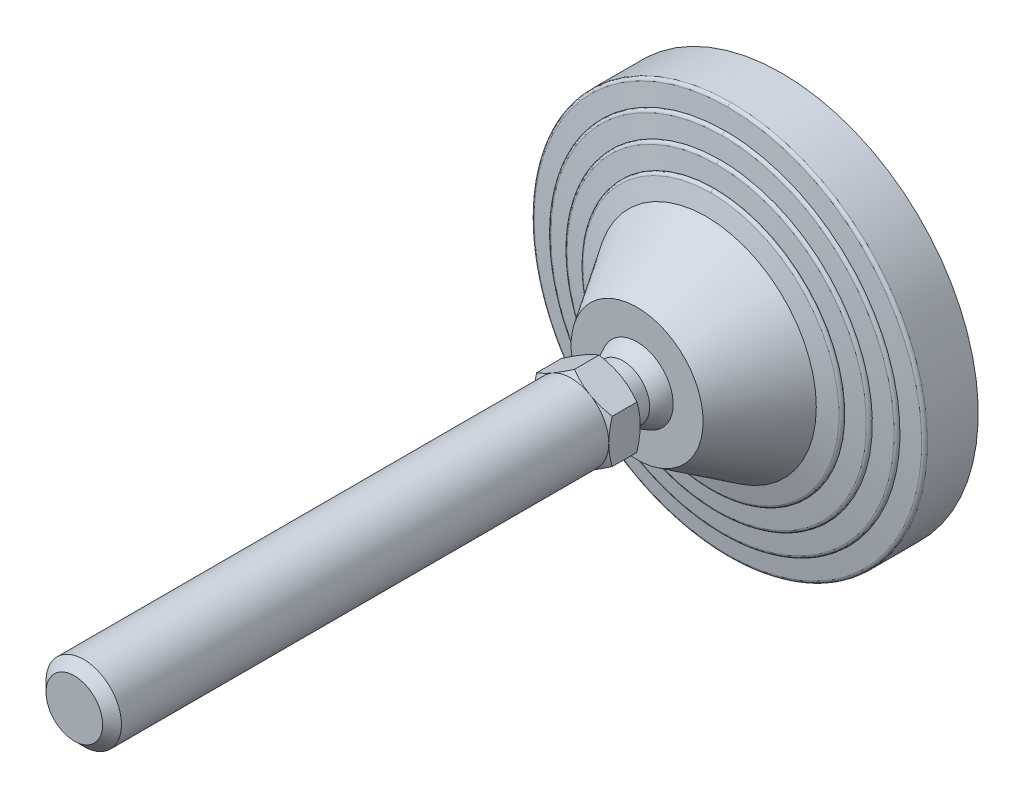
ISO-10303-21;
HEADER;
FILE_DESCRIPTION(('STEP AP214'),'2;1');
FILE_NAME('part.step','',(''),(''),'','','');
FILE_SCHEMA(('AUTOMOTIVE_DESIGN { 1 0 10303 214 1 1 1 1 }'));
ENDSEC;
DATA;
#1=APPLICATION_CONTEXT('core data for automotive mechanical design processes');
#2=APPLICATION_PROTOCOL_DEFINITION('international standard','automotive_design',2000,#1);
#3=PRODUCT_CONTEXT('',#1,'mechanical');
#4=PRODUCT('Part','Part','',(#3));
#5=PRODUCT_RELATED_PRODUCT_CATEGORY('part','',(#4));
#6=PRODUCT_DEFINITION_FORMATION('','',#4);
#7=PRODUCT_DEFINITION_CONTEXT('part definition',#1,'design');
#8=PRODUCT_DEFINITION('design','',#6,#7);
#9=PRODUCT_DEFINITION_SHAPE('','',#8);
#10=(LENGTH_UNIT() NAMED_UNIT(*) SI_UNIT(.MILLI.,.METRE.));
#11=(NAMED_UNIT(*) PLANE_ANGLE_UNIT() SI_UNIT($,.RADIAN.));
#12=(NAMED_UNIT(*) SI_UNIT($,.STERADIAN.) SOLID_ANGLE_UNIT());
#13=UNCERTAINTY_MEASURE_WITH_UNIT(LENGTH_MEASURE(1.E-05),#10,'distance_accuracy_value','');
#14=(GEOMETRIC_REPRESENTATION_CONTEXT(3) GLOBAL_UNCERTAINTY_ASSIGNED_CONTEXT((#13)) GLOBAL_UNIT_ASSIGNED_CONTEXT((#10,
#11,#12)) REPRESENTATION_CONTEXT('',''));
#15=CARTESIAN_POINT('',(0.,0.,0.));
#16=DIRECTION('',(0.,0.,1.));
#17=DIRECTION('',(1.,0.,0.));
#18=AXIS2_PLACEMENT_3D('',#15,#16,#17);
#19=CARTESIAN_POINT('',(-55.851524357,55.66,0.));
#20=DIRECTION('',(0.,0.,1.));
#21=DIRECTION('',(0.,-1.,0.));
#22=AXIS2_PLACEMENT_3D('',#19,#20,#21);
#23=PLANE('',#22);
#24=CARTESIAN_POINT('',(0.,0.,0.));
#25=DIRECTION('',(0.,0.,-1.));
#26=DIRECTION('',(0.,1.,0.));
#27=AXIS2_PLACEMENT_3D('',#24,#25,#26);
#28=CIRCLE('',#27,55.);
#29=CARTESIAN_POINT('',(0.,55.,0.));
#30=VERTEX_POINT('',#29);
#31=EDGE_CURVE('E431',#30,#30,#28,.F.);
#32=ORIENTED_EDGE('',*,*,#31,.F.);
#33=EDGE_LOOP('',(#32));
#34=FACE_BOUND('',#33,.T.);
#35=ADVANCED_FACE('F14',(#34),#23,.F.);
#36=CARTESIAN_POINT('',(0.,0.,3.));
#37=DIRECTION('',(0.,0.,-1.));
#38=DIRECTION('',(0.,1.,0.));
#39=AXIS2_PLACEMENT_3D('',#36,#37,#38);
#40=CYLINDRICAL_SURFACE('',#39,55.);
#41=ORIENTED_EDGE('',*,*,#31,.T.);
#42=EDGE_LOOP('',(#41));
#43=FACE_BOUND('',#42,.T.);
#44=CARTESIAN_POINT('',(0.,0.,3.));
#45=DIRECTION('',(0.,0.,-1.));
#46=DIRECTION('',(0.,1.,0.));
#47=AXIS2_PLACEMENT_3D('',#44,#45,#46);
#48=CIRCLE('',#47,55.);
#49=CARTESIAN_POINT('',(0.,55.,3.));
#50=VERTEX_POINT('',#49);
#51=EDGE_CURVE('E428',#50,#50,#48,.T.);
#52=ORIENTED_EDGE('',*,*,#51,.T.);
#53=EDGE_LOOP('',(#52));
#54=FACE_BOUND('',#53,.T.);
#55=ADVANCED_FACE('F287',(#43,#54),#40,.T.);
#56=CARTESIAN_POINT('',(-63.467641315,63.25,2.99999999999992));
#57=DIRECTION('',(0.,0.,1.));
#58=DIRECTION('',(0.,-1.,0.));
#59=AXIS2_PLACEMENT_3D('',#56,#57,#58);
#60=PLANE('',#59);
#61=ORIENTED_EDGE('',*,*,#51,.F.);
#62=EDGE_LOOP('',(#61));
#63=FACE_BOUND('',#62,.T.);
#64=CARTESIAN_POINT('',(0.,0.,3.));
#65=DIRECTION('',(0.,0.,-1.));
#66=DIRECTION('',(0.,1.,0.));
#67=AXIS2_PLACEMENT_3D('',#64,#65,#66);
#68=CIRCLE('',#67,62.5);
#69=CARTESIAN_POINT('',(0.,62.5,3.));
#70=VERTEX_POINT('',#69);
#71=EDGE_CURVE('E424',#70,#70,#68,.F.);
#72=ORIENTED_EDGE('',*,*,#71,.F.);
#73=EDGE_LOOP('',(#72));
#74=FACE_BOUND('',#73,.T.);
#75=ADVANCED_FACE('F283',(#63,#74),#60,.F.);
#76=CARTESIAN_POINT('',(0.,0.,19.119206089));
#77=DIRECTION('',(0.,0.,-1.));
#78=DIRECTION('',(0.,1.,0.));
#79=AXIS2_PLACEMENT_3D('',#76,#77,#78);
#80=CYLINDRICAL_SURFACE('',#79,62.5);
#81=ORIENTED_EDGE('',*,*,#71,.T.);
#82=EDGE_LOOP('',(#81));
#83=FACE_BOUND('',#82,.T.);
#84=CARTESIAN_POINT('',(0.,0.,19.119206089));
#85=DIRECTION('',(0.,0.,1.));
#86=DIRECTION('',(0.,-1.,0.));
#87=AXIS2_PLACEMENT_3D('',#84,#85,#86);
#88=CIRCLE('',#87,62.5);
#89=CARTESIAN_POINT('',(-6.40950425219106E-09,-62.5,19.119206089));
#90=VERTEX_POINT('',#89);
#91=CARTESIAN_POINT('',(0.,62.5,19.119206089));
#92=VERTEX_POINT('',#91);
#93=EDGE_CURVE('E583',#90,#92,#88,.T.);
#94=ORIENTED_EDGE('',*,*,#93,.F.);
#95=CARTESIAN_POINT('',(0.,0.,19.119206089));
#96=DIRECTION('',(0.,0.,1.));
#97=DIRECTION('',(0.,-1.,0.));
#98=AXIS2_PLACEMENT_3D('',#95,#96,#97);
#99=CIRCLE('',#98,62.5);
#100=EDGE_CURVE('E427',#92,#90,#99,.T.);
#101=ORIENTED_EDGE('',*,*,#100,.F.);
#102=EDGE_LOOP('',(#94,#101));
#103=FACE_BOUND('',#102,.T.);
#104=ADVANCED_FACE('F286',(#83,#103),#80,.T.);
#105=CARTESIAN_POINT('',(0.,-62.5,19.119206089));
#106=CARTESIAN_POINT('',(-125.,-62.5,19.1192060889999));
#107=CARTESIAN_POINT('',(-125.,62.5,19.1192060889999));
#108=CARTESIAN_POINT('',(0.,62.5,19.119206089));
#109=CARTESIAN_POINT('',(0.,-62.5,19.647800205));
#110=CARTESIAN_POINT('',(-125.,-62.5,19.6478002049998));
#111=CARTESIAN_POINT('',(-125.,62.5,19.6478002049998));
#112=CARTESIAN_POINT('',(0.,62.5,19.647800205));
#113=CARTESIAN_POINT('',(0.,-62.150618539,20.044466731));
#114=CARTESIAN_POINT('',(-124.301237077,-62.1506185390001,20.0444667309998));
#115=CARTESIAN_POINT('',(-124.301237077,62.1506185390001,20.0444667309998));
#116=CARTESIAN_POINT('',(0.,62.150618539,20.044466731));
#117=CARTESIAN_POINT('',(0.,-61.62625428,20.111204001));
#118=CARTESIAN_POINT('',(-123.252508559,-61.6262542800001,20.1112040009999));
#119=CARTESIAN_POINT('',(-123.252508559,61.6262542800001,20.1112040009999));
#120=CARTESIAN_POINT('',(0.,61.62625428,20.111204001));
#121=(BOUNDED_SURFACE() B_SPLINE_SURFACE(3,3,((#105,#106,#107,#108),(#109,#110,#111,#112),(#113,
#114,#115,#116),(#117,#118,#119,#120)),.UNSPECIFIED.,.F.,.F.,
.F.) B_SPLINE_SURFACE_WITH_KNOTS((4,4),(4,4),(0.,1.),(0.,1.),
.UNSPECIFIED.) GEOMETRIC_REPRESENTATION_ITEM() RATIONAL_B_SPLINE_SURFACE(((1.,0.333333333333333,
0.333333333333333,1.),(0.833611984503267,0.277870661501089,0.277870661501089,0.833611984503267),
(0.833611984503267,0.277870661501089,0.277870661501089,0.833611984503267),(1.,0.333333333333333,
0.333333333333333,1.))) REPRESENTATION_ITEM('') SURFACE());
#122=CARTESIAN_POINT('',(0.,62.5,19.119206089));
#123=CARTESIAN_POINT('',(0.,62.5,19.647800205));
#124=CARTESIAN_POINT('',(0.,62.150618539,20.044466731));
#125=CARTESIAN_POINT('',(0.,61.62625428,20.111204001));
#126=(BOUNDED_CURVE() B_SPLINE_CURVE(3,(#122,#123,#124,#125),.UNSPECIFIED.,.F.,
.F.) B_SPLINE_CURVE_WITH_KNOTS((4,4),(0.,1.),
.UNSPECIFIED.) CURVE() GEOMETRIC_REPRESENTATION_ITEM() RATIONAL_B_SPLINE_CURVE((1.,
0.833611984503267,0.833611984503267,1.)) REPRESENTATION_ITEM(''));
#127=CARTESIAN_POINT('',(0.,61.6262542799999,20.1112040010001));
#128=VERTEX_POINT('',#127);
#129=EDGE_CURVE('E574',#92,#128,#126,.T.);
#130=CARTESIAN_POINT('',(0.,-62.5,19.119206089));
#131=CARTESIAN_POINT('',(0.,-62.5,19.647800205));
#132=CARTESIAN_POINT('',(0.,-62.150618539,20.044466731));
#133=CARTESIAN_POINT('',(0.,-61.62625428,20.111204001));
#134=(BOUNDED_CURVE() B_SPLINE_CURVE(3,(#130,#131,#132,#133),.UNSPECIFIED.,.F.,
.F.) B_SPLINE_CURVE_WITH_KNOTS((4,4),(0.,1.),
.UNSPECIFIED.) CURVE() GEOMETRIC_REPRESENTATION_ITEM() RATIONAL_B_SPLINE_CURVE((1.,
0.833611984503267,0.833611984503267,1.)) REPRESENTATION_ITEM(''));
#135=CARTESIAN_POINT('',(-1.89596573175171E-08,-61.6262542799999,20.1112040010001));
#136=VERTEX_POINT('',#135);
#137=EDGE_CURVE('E588',#136,#90,#134,.F.);
#138=CARTESIAN_POINT('',(0.,0.,20.1112040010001));
#139=DIRECTION('',(0.,0.,-1.));
#140=DIRECTION('',(0.,1.,0.));
#141=AXIS2_PLACEMENT_3D('',#138,#139,#140);
#142=CIRCLE('',#141,61.62625428);
#143=EDGE_CURVE('E567',#128,#136,#142,.F.);
#144=ORIENTED_EDGE('',*,*,#129,.F.);
#145=ORIENTED_EDGE('',*,*,#100,.T.);
#146=ORIENTED_EDGE('',*,*,#137,.F.);
#147=ORIENTED_EDGE('',*,*,#143,.F.);
#148=EDGE_LOOP('',(#144,#145,#146,#147));
#149=FACE_BOUND('',#148,.T.);
#150=ADVANCED_FACE('F944',(#149),#121,.T.);
#151=CARTESIAN_POINT('',(0.,62.5,19.119206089));
#152=CARTESIAN_POINT('',(125.,62.5,19.1192060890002));
#153=CARTESIAN_POINT('',(125.,-62.5,19.1192060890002));
#154=CARTESIAN_POINT('',(0.,-62.5,19.119206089));
#155=CARTESIAN_POINT('',(0.,62.5,19.647800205));
#156=CARTESIAN_POINT('',(125.,62.5,19.6478002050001));
#157=CARTESIAN_POINT('',(125.,-62.5,19.6478002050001));
#158=CARTESIAN_POINT('',(0.,-62.5,19.647800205));
#159=CARTESIAN_POINT('',(0.,62.150618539,20.044466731));
#160=CARTESIAN_POINT('',(124.301237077,62.1506185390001,20.0444667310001));
#161=CARTESIAN_POINT('',(124.301237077,-62.1506185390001,20.0444667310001));
#162=CARTESIAN_POINT('',(0.,-62.150618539,20.044466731));
#163=CARTESIAN_POINT('',(0.,61.62625428,20.111204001));
#164=CARTESIAN_POINT('',(123.252508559,61.6262542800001,20.1112040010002));
#165=CARTESIAN_POINT('',(123.252508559,-61.6262542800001,20.1112040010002));
#166=CARTESIAN_POINT('',(0.,-61.62625428,20.111204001));
#167=(BOUNDED_SURFACE() B_SPLINE_SURFACE(3,3,((#151,#152,#153,#154),(#155,#156,#157,#158),(#159,
#160,#161,#162),(#163,#164,#165,#166)),.UNSPECIFIED.,.F.,.F.,
.F.) B_SPLINE_SURFACE_WITH_KNOTS((4,4),(4,4),(0.,1.),(0.,1.),
.UNSPECIFIED.) GEOMETRIC_REPRESENTATION_ITEM() RATIONAL_B_SPLINE_SURFACE(((1.,0.333333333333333,
0.333333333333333,1.),(0.833611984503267,0.277870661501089,0.277870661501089,0.833611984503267),
(0.833611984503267,0.277870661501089,0.277870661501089,0.833611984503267),(1.,0.333333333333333,
0.333333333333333,1.))) REPRESENTATION_ITEM('') SURFACE());
#168=CARTESIAN_POINT('',(0.,0.,20.1112040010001));
#169=DIRECTION('',(0.,0.,-1.));
#170=DIRECTION('',(0.,1.,0.));
#171=AXIS2_PLACEMENT_3D('',#168,#169,#170);
#172=CIRCLE('',#171,61.62625428);
#173=EDGE_CURVE('E573',#136,#128,#172,.F.);
#174=ORIENTED_EDGE('',*,*,#93,.T.);
#175=ORIENTED_EDGE('',*,*,#129,.T.);
#176=ORIENTED_EDGE('',*,*,#173,.F.);
#177=ORIENTED_EDGE('',*,*,#137,.T.);
#178=EDGE_LOOP('',(#174,#175,#176,#177));
#179=FACE_BOUND('',#178,.T.);
#180=ADVANCED_FACE('F409',(#179),#167,.T.);
#181=CARTESIAN_POINT('',(0.,0.,20.890909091));
#182=DIRECTION('',(0.,0.,-1.));
#183=DIRECTION('',(1.,0.,0.));
#184=AXIS2_PLACEMENT_3D('',#181,#182,#183);
#185=CONICAL_SURFACE('',#184,55.5,1.44420419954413);
#186=ORIENTED_EDGE('',*,*,#143,.T.);
#187=ORIENTED_EDGE('',*,*,#173,.T.);
#188=EDGE_LOOP('',(#186,#187));
#189=FACE_BOUND('',#188,.T.);
#190=CARTESIAN_POINT('',(-1.13831199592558E-08,-55.5,20.890909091));
#191=CARTESIAN_POINT('',(0.666810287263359,-55.5000058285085,20.890909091));
#192=CARTESIAN_POINT('',(1.3336215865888,-55.4879831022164,20.890909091));
#193=CARTESIAN_POINT('',(2.66828219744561,-55.4398527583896,20.890909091));
#194=CARTESIAN_POINT('',(3.33612903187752,-55.4036764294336,20.890909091));
#195=CARTESIAN_POINT('',(4.67008368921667,-55.3072108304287,20.890909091));
#196=CARTESIAN_POINT('',(5.33619149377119,-55.2469213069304,20.890909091));
#197=CARTESIAN_POINT('',(6.66630694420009,-55.1022519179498,20.890909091));
#198=CARTESIAN_POINT('',(7.3303126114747,-55.0178537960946,20.890909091));
#199=CARTESIAN_POINT('',(8.65488946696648,-54.8250946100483,20.890909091));
#200=CARTESIAN_POINT('',(9.31546019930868,-54.7167304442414,20.890909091));
#201=CARTESIAN_POINT('',(11.3032442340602,-54.3535835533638,20.890909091));
#202=CARTESIAN_POINT('',(12.623956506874,-54.0621103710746,20.890909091));
#203=CARTESIAN_POINT('',(15.2407929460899,-53.3834839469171,20.890909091));
#204=CARTESIAN_POINT('',(16.5369104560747,-52.9963051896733,20.890909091));
#205=CARTESIAN_POINT('',(19.0989356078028,-52.1278427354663,20.890909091));
#206=CARTESIAN_POINT('',(20.3648068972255,-51.646451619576,20.890909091));
#207=CARTESIAN_POINT('',(22.8579438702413,-50.5924539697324,20.890909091));
#208=CARTESIAN_POINT('',(24.0852091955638,-50.019846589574,20.8909090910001));
#209=CARTESIAN_POINT('',(26.6786676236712,-48.692216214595,20.8909090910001));
#210=CARTESIAN_POINT('',(28.0374663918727,-47.9226902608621,20.890909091));
#211=CARTESIAN_POINT('',(30.6855194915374,-46.2718474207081,20.890909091));
#212=CARTESIAN_POINT('',(31.9747656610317,-45.3905174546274,20.890909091));
#213=CARTESIAN_POINT('',(34.4745529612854,-43.5222940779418,20.890909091));
#214=CARTESIAN_POINT('',(35.6850872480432,-42.5353915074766,20.890909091));
#215=CARTESIAN_POINT('',(38.0186685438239,-40.4631409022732,20.890909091));
#216=CARTESIAN_POINT('',(39.1417181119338,-39.3777957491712,20.890909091));
#217=CARTESIAN_POINT('',(41.2923479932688,-37.1163936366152,20.8909090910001));
#218=CARTESIAN_POINT('',(42.3199319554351,-35.9403401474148,20.8909090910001));
#219=CARTESIAN_POINT('',(44.2723789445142,-33.5058382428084,20.890909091));
#220=CARTESIAN_POINT('',(45.1972412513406,-32.2473892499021,20.890909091));
#221=CARTESIAN_POINT('',(46.9376312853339,-29.6570957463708,20.890909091));
#222=CARTESIAN_POINT('',(47.7531628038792,-28.325253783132,20.8909090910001));
#223=CARTESIAN_POINT('',(49.2691299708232,-25.5976050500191,20.8909090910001));
#224=CARTESIAN_POINT('',(49.9695658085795,-24.2017983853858,20.8909090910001));
#225=CARTESIAN_POINT('',(51.2503706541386,-21.3561258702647,20.8909090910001));
#226=CARTESIAN_POINT('',(51.8307383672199,-19.9062594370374,20.8909090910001));
#227=CARTESIAN_POINT('',(52.867271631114,-16.9627885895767,20.8909090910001));
#228=CARTESIAN_POINT('',(53.3234371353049,-15.4691841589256,20.8909090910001));
#229=CARTESIAN_POINT('',(54.1083272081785,-12.4488388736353,20.8909090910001));
#230=CARTESIAN_POINT('',(54.4370503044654,-10.922097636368,20.8909090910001));
#231=CARTESIAN_POINT('',(54.9647110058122,-7.84634988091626,20.8909090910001));
#232=CARTESIAN_POINT('',(55.1636486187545,-6.29734336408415,20.8909090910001));
#233=CARTESIAN_POINT('',(55.4303245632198,-3.18807153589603,20.8909090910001));
#234=CARTESIAN_POINT('',(55.4980623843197,-1.62780618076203,20.8909090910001));
#235=CARTESIAN_POINT('',(55.5018556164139,1.49288460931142,20.8909090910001));
#236=CARTESIAN_POINT('',(55.437911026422,3.05331004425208,20.8909090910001));
#237=CARTESIAN_POINT('',(55.1787965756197,6.16319684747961,20.8909090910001));
#238=CARTESIAN_POINT('',(54.9836292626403,7.71265842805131,20.8909090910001));
#239=CARTESIAN_POINT('',(54.463459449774,10.7896325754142,20.8909090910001));
#240=CARTESIAN_POINT('',(54.1384569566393,12.3171451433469,20.8909090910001));
#241=CARTESIAN_POINT('',(53.3609336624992,15.339337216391,20.8909090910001));
#242=CARTESIAN_POINT('',(52.9084149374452,16.8340172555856,20.8909090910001));
#243=CARTESIAN_POINT('',(51.8790738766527,19.7799443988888,20.8909090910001));
#244=CARTESIAN_POINT('',(51.3022515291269,21.2311914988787,20.8909090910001));
#245=CARTESIAN_POINT('',(50.0283709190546,24.0800097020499,20.8909090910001));
#246=CARTESIAN_POINT('',(49.3313064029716,25.4775780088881,20.8909090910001));
#247=CARTESIAN_POINT('',(47.8219174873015,28.2090226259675,20.8909090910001));
#248=CARTESIAN_POINT('',(47.0095931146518,29.542898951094,20.8909090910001));
#249=CARTESIAN_POINT('',(45.2754391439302,32.1375097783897,20.8909090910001));
#250=CARTESIAN_POINT('',(44.3536065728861,33.398242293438,20.890909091));
#251=CARTESIAN_POINT('',(42.40699610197,35.8375708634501,20.890909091));
#252=CARTESIAN_POINT('',(41.382218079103,37.0161668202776,20.890909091));
#253=CARTESIAN_POINT('',(39.237157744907,39.2826945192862,20.890909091));
#254=CARTESIAN_POINT('',(38.1168855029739,40.3706357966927,20.890909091));
#255=CARTESIAN_POINT('',(35.7885615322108,42.4483529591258,20.890909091));
#256=CARTESIAN_POINT('',(34.5805102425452,43.4381293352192,20.8909090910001));
#257=CARTESIAN_POINT('',(32.5014047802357,44.9999063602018,20.890909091));
#258=CARTESIAN_POINT('',(31.6521856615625,45.6012216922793,20.890909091));
#259=CARTESIAN_POINT('',(29.9212415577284,46.7552239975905,20.890909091));
#260=CARTESIAN_POINT('',(29.0395163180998,47.3079105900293,20.890909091));
#261=CARTESIAN_POINT('',(27.2463975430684,48.3628576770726,20.890909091));
#262=CARTESIAN_POINT('',(26.3350034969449,48.865117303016,20.890909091));
#263=CARTESIAN_POINT('',(24.4853750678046,49.8176528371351,20.890909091));
#264=CARTESIAN_POINT('',(23.5471392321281,50.2679259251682,20.890909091));
#265=CARTESIAN_POINT('',(21.6468644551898,51.1150215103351,20.890909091));
#266=CARTESIAN_POINT('',(20.6848259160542,51.5118449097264,20.890909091));
#267=CARTESIAN_POINT('',(18.7400290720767,52.2507726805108,20.890909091));
#268=CARTESIAN_POINT('',(17.7572723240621,52.5928811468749,20.890909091));
#269=CARTESIAN_POINT('',(15.8636176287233,53.19296174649,20.890909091));
#270=CARTESIAN_POINT('',(14.9542390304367,53.4557406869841,20.890909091));
#271=CARTESIAN_POINT('',(13.1232854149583,53.9344479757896,20.890909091));
#272=CARTESIAN_POINT('',(12.2017111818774,54.1503793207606,20.890909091));
#273=CARTESIAN_POINT('',(10.3487557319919,54.5348378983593,20.890909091));
#274=CARTESIAN_POINT('',(9.41737477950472,54.7033664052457,20.890909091));
#275=CARTESIAN_POINT('',(7.54728204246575,54.9925789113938,20.890909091));
#276=CARTESIAN_POINT('',(6.6085707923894,55.1132663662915,20.890909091));
#277=CARTESIAN_POINT('',(4.72616569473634,55.3064952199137,20.890909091));
#278=CARTESIAN_POINT('',(3.7824716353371,55.3790345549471,20.890909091));
#279=CARTESIAN_POINT('',(1.89251924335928,55.4758006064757,20.890909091));
#280=CARTESIAN_POINT('',(0.946260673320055,55.5000226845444,20.890909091));
#281=CARTESIAN_POINT('',(-1.66118914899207E-09,55.5,20.890909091));
#282=B_SPLINE_CURVE_WITH_KNOTS('',3,(#190,#191,#192,#193,#194,#195,#196,#197,#198,#199,#200,
#201,#202,#203,#204,#205,#206,#207,#208,#209,#210,#211,#212,#213,#214,#215,#216,#217,#218,#219,
#220,#221,#222,#223,#224,#225,#226,#227,#228,#229,#230,#231,#232,#233,#234,#235,#236,#237,#238,
#239,#240,#241,#242,#243,#244,#245,#246,#247,#248,#249,#250,#251,#252,#253,#254,#255,#256,#257,
#258,#259,#260,#261,#262,#263,#264,#265,#266,#267,#268,#269,#270,#271,#272,#273,#274,#275,#276,
#277,#278,#279,#280,#281),.UNSPECIFIED.,.F.,.F.,(4,2,2,2,2,2,2,2,2,2,2,2,2,2,2,2,2,2,2,2,2,2,2,
2,2,2,2,2,2,2,2,2,2,2,2,2,2,2,2,2,2,2,2,2,2,4),(0.,2.00032482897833,4.0063645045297,
6.01242526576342,8.02000917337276,10.0278530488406,14.0813911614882,18.1360111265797,
22.1952813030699,26.2545891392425,30.9336173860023,35.6131935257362,40.2931760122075,
44.9730215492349,49.652688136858,54.3323875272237,59.0119245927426,63.6914539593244,
68.37103378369,73.050615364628,77.7302510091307,82.4098863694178,87.0895399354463,
91.7691935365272,96.4487562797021,101.12831877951,105.807805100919,110.487291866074,
115.167022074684,119.846751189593,124.526607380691,129.206469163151,133.885838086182,
138.565183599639,141.685351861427,144.805544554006,147.925790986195,151.046206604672,
154.166569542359,157.28669883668,160.12523673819,162.963593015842,165.801872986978,
168.639947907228,171.478144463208,174.316613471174),.UNSPECIFIED.);
#283=CARTESIAN_POINT('',(-1.1383263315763E-08,-55.5,20.895966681));
#284=VERTEX_POINT('',#283);
#285=CARTESIAN_POINT('',(-1.661207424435E-09,55.5,20.895966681));
#286=VERTEX_POINT('',#285);
#287=EDGE_CURVE('E390',#284,#286,#282,.T.);
#288=ORIENTED_EDGE('',*,*,#287,.F.);
#289=CARTESIAN_POINT('',(-1.6612040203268E-09,55.5,20.890909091));
#290=CARTESIAN_POINT('',(-0.666810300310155,55.5000058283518,20.890909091));
#291=CARTESIAN_POINT('',(-1.33362159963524,55.4879831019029,20.890909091));
#292=CARTESIAN_POINT('',(-2.6682822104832,55.4398527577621,20.890909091));
#293=CARTESIAN_POINT('',(-3.3361290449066,55.403676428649,20.890909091));
#294=CARTESIAN_POINT('',(-4.67008370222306,55.3072108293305,20.890909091));
#295=CARTESIAN_POINT('',(-5.33619150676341,55.2469213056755,20.890909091));
#296=CARTESIAN_POINT('',(-6.66630695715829,55.1022519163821,20.890909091));
#297=CARTESIAN_POINT('',(-7.33031262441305,55.0178537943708,20.890909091));
#298=CARTESIAN_POINT('',(-8.6548894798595,54.8250946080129,20.890909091));
#299=CARTESIAN_POINT('',(-9.31546021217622,54.7167304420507,20.890909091));
#300=CARTESIAN_POINT('',(-11.3032442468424,54.3535835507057,20.890909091));
#301=CARTESIAN_POINT('',(-12.6239565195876,54.0621103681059,20.890909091));
#302=CARTESIAN_POINT('',(-15.2407929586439,53.383483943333,20.890909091));
#303=CARTESIAN_POINT('',(-16.5369104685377,52.9963051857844,20.890909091));
#304=CARTESIAN_POINT('',(-19.0989356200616,52.1278427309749,20.890909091));
#305=CARTESIAN_POINT('',(-20.364806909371,51.6464516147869,20.890909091));
#306=CARTESIAN_POINT('',(-22.8579438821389,50.592453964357,20.890909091));
#307=CARTESIAN_POINT('',(-24.0852092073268,50.0198465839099,20.890909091));
#308=CARTESIAN_POINT('',(-26.678667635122,48.692216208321,20.8909090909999));
#309=CARTESIAN_POINT('',(-28.0374664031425,47.9226902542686,20.890909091));
#310=CARTESIAN_POINT('',(-30.685519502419,46.2718474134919,20.890909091));
#311=CARTESIAN_POINT('',(-31.974765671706,45.390517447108,20.890909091));
#312=CARTESIAN_POINT('',(-34.4745529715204,43.5222940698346,20.890909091));
#313=CARTESIAN_POINT('',(-35.6850872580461,42.5353914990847,20.890909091));
#314=CARTESIAN_POINT('',(-38.0186685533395,40.4631408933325,20.890909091));
#315=CARTESIAN_POINT('',(-39.1417181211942,39.3777957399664,20.890909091));
#316=CARTESIAN_POINT('',(-41.2923480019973,37.1163936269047,20.890909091));
#317=CARTESIAN_POINT('',(-42.319931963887,35.9403401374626,20.890909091));
#318=CARTESIAN_POINT('',(-44.2723789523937,33.5058382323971,20.890909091));
#319=CARTESIAN_POINT('',(-45.1972412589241,32.2473892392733,20.890909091));
#320=CARTESIAN_POINT('',(-46.9376312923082,29.6570957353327,20.8909090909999));
#321=CARTESIAN_POINT('',(-47.7531628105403,28.3252537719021,20.8909090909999));
#322=CARTESIAN_POINT('',(-49.2691299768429,25.5976050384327,20.8909090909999));
#323=CARTESIAN_POINT('',(-49.9695658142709,24.2017983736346,20.890909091));
#324=CARTESIAN_POINT('',(-51.2503706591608,21.3561258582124,20.890909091));
#325=CARTESIAN_POINT('',(-51.8307383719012,19.9062594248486,20.8909090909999));
#326=CARTESIAN_POINT('',(-52.8672716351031,16.9627885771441,20.8909090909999));
#327=CARTESIAN_POINT('',(-53.3234371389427,15.4691841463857,20.8909090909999));
#328=CARTESIAN_POINT('',(-54.108327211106,12.4488388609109,20.8909090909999));
#329=CARTESIAN_POINT('',(-54.4370503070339,10.9220976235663,20.8909090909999));
#330=CARTESIAN_POINT('',(-54.9647110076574,7.84634986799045,20.8909090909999));
#331=CARTESIAN_POINT('',(-55.1636486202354,6.29734335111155,20.890909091));
#332=CARTESIAN_POINT('',(-55.4303245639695,3.18807152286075,20.890909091));
#333=CARTESIAN_POINT('',(-55.4980623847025,1.62780616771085,20.8909090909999));
#334=CARTESIAN_POINT('',(-55.5018556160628,-1.49288462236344,20.8909090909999));
#335=CARTESIAN_POINT('',(-55.4379110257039,-3.05331005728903,20.8909090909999));
#336=CARTESIAN_POINT('',(-55.1787965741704,-6.16319686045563,20.8909090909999));
#337=CARTESIAN_POINT('',(-54.9836292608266,-7.71265844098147,20.8909090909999));
#338=CARTESIAN_POINT('',(-54.4634594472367,-10.7896325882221,20.8909090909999));
#339=CARTESIAN_POINT('',(-54.1384569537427,-12.3171451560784,20.890909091));
#340=CARTESIAN_POINT('',(-53.3609336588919,-15.3393372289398,20.890909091));
#341=CARTESIAN_POINT('',(-52.9084149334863,-16.8340172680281,20.8909090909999));
#342=CARTESIAN_POINT('',(-51.879073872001,-19.7799444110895,20.8909090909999));
#343=CARTESIAN_POINT('',(-51.3022515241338,-21.2311915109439,20.8909090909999));
#344=CARTESIAN_POINT('',(-50.0283709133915,-24.0800097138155,20.8909090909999));
#345=CARTESIAN_POINT('',(-49.3313063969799,-25.4775780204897,20.8909090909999));
#346=CARTESIAN_POINT('',(-47.8219174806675,-28.2090226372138,20.8909090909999));
#347=CARTESIAN_POINT('',(-47.0095931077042,-29.5428989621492,20.8909090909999));
#348=CARTESIAN_POINT('',(-45.2754391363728,-32.1375097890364,20.890909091));
#349=CARTESIAN_POINT('',(-44.3536065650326,-33.3982423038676,20.890909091));
#350=CARTESIAN_POINT('',(-42.4069960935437,-35.837570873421,20.890909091));
#351=CARTESIAN_POINT('',(-41.3822180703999,-37.0161668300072,20.890909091));
#352=CARTESIAN_POINT('',(-39.237157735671,-39.2826945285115,20.890909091));
#353=CARTESIAN_POINT('',(-38.1168854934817,-40.3706358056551,20.890909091));
#354=CARTESIAN_POINT('',(-35.7885615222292,-42.4483529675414,20.890909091));
#355=CARTESIAN_POINT('',(-34.5805102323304,-43.438129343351,20.8909090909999));
#356=CARTESIAN_POINT('',(-32.5014047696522,-44.9999063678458,20.890909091));
#357=CARTESIAN_POINT('',(-31.6521856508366,-45.6012216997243,20.890909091));
#358=CARTESIAN_POINT('',(-29.9212415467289,-46.7552240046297,20.890909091));
#359=CARTESIAN_POINT('',(-29.0395163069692,-47.3079105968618,20.890909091));
#360=CARTESIAN_POINT('',(-27.246397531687,-48.3628576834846,20.890909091));
#361=CARTESIAN_POINT('',(-26.335003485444,-48.8651173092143,20.890909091));
#362=CARTESIAN_POINT('',(-24.4853750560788,-49.8176528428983,20.890909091));
#363=CARTESIAN_POINT('',(-23.5471392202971,-50.2679259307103,20.890909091));
#364=CARTESIAN_POINT('',(-21.6468644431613,-51.1150215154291,20.890909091));
#365=CARTESIAN_POINT('',(-20.6848259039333,-51.5118449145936,20.890909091));
#366=CARTESIAN_POINT('',(-18.7400290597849,-52.2507726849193,20.890909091));
#367=CARTESIAN_POINT('',(-17.7572723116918,-52.5928811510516,20.890909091));
#368=CARTESIAN_POINT('',(-15.8636176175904,-53.1929617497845,20.890909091));
#369=CARTESIAN_POINT('',(-14.9542390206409,-53.4557406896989,20.890909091));
#370=CARTESIAN_POINT('',(-13.1232854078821,-53.934447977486,20.890909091));
#371=CARTESIAN_POINT('',(-12.2017111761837,-54.1503793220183,20.890909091));
#372=CARTESIAN_POINT('',(-10.3487557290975,-54.5348378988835,20.890909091));
#373=CARTESIAN_POINT('',(-9.4173747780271,-54.703366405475,20.890909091));
#374=CARTESIAN_POINT('',(-7.54728204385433,-54.9925789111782,20.890909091));
#375=CARTESIAN_POINT('',(-6.60857079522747,-55.1132663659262,20.890909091));
#376=CARTESIAN_POINT('',(-4.72616570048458,-55.3064952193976,20.890909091));
#377=CARTESIAN_POINT('',(-3.782471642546,-55.3790345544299,20.890909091));
#378=CARTESIAN_POINT('',(-1.89251925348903,-55.4758006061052,20.890909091));
#379=CARTESIAN_POINT('',(-0.946260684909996,-55.5000226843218,20.890909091));
#380=CARTESIAN_POINT('',(-1.13832617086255E-08,-55.5,20.890909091));
#381=B_SPLINE_CURVE_WITH_KNOTS('',3,(#289,#290,#291,#292,#293,#294,#295,#296,#297,#298,#299,
#300,#301,#302,#303,#304,#305,#306,#307,#308,#309,#310,#311,#312,#313,#314,#315,#316,#317,#318,
#319,#320,#321,#322,#323,#324,#325,#326,#327,#328,#329,#330,#331,#332,#333,#334,#335,#336,#337,
#338,#339,#340,#341,#342,#343,#344,#345,#346,#347,#348,#349,#350,#351,#352,#353,#354,#355,#356,
#357,#358,#359,#360,#361,#362,#363,#364,#365,#366,#367,#368,#369,#370,#371,#372,#373,#374,#375,
#376,#377,#378,#379,#380),.UNSPECIFIED.,.F.,.F.,(4,2,2,2,2,2,2,2,2,2,2,2,2,2,2,2,2,2,2,2,2,2,2,
2,2,2,2,2,2,2,2,2,2,2,2,2,2,2,2,2,2,2,2,2,2,4),(0.,2.00032482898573,4.00636450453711,
6.01242526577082,8.02000917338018,10.027853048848,14.0813911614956,18.1360111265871,
22.1952813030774,26.2545891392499,30.9336173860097,35.6131935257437,40.2931760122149,
44.9730215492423,49.6526881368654,54.3323875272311,59.0119245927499,63.6914539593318,
68.3710337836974,73.0506153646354,77.7302510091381,82.4098863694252,87.0895399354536,
91.7691935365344,96.4487562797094,101.128318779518,105.807805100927,110.487291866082,
115.167022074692,119.8467511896,124.526607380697,129.206469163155,133.885838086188,
138.565183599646,141.685351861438,144.805544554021,147.925790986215,151.046206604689,
154.166569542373,157.286698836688,160.125236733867,162.963593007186,165.801872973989,
168.639947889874,171.47814444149,174.316613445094),.UNSPECIFIED.);
#382=EDGE_CURVE('E402',#286,#284,#381,.T.);
#383=ORIENTED_EDGE('',*,*,#382,.F.);
#384=EDGE_LOOP('',(#288,#383));
#385=FACE_BOUND('',#384,.T.);
#386=ADVANCED_FACE('F404',(#189,#385),#185,.T.);
#387=CARTESIAN_POINT('',(0.,-55.5,20.887804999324));
#388=CARTESIAN_POINT('',(-111.,-55.5000000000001,20.8878049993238));
#389=CARTESIAN_POINT('',(-111.,55.5000000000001,20.8878049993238));
#390=CARTESIAN_POINT('',(0.,55.5,20.887804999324));
#391=CARTESIAN_POINT('',(0.,-55.5,20.892211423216));
#392=CARTESIAN_POINT('',(-111.,-55.5000000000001,20.8922114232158));
#393=CARTESIAN_POINT('',(-111.,55.5000000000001,20.8922114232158));
#394=CARTESIAN_POINT('',(0.,55.5,20.892211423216));
#395=CARTESIAN_POINT('',(0.,-55.5,20.896617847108));
#396=CARTESIAN_POINT('',(-111.,-55.5000000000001,20.8966178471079));
#397=CARTESIAN_POINT('',(-111.,55.5000000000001,20.8966178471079));
#398=CARTESIAN_POINT('',(0.,55.5,20.896617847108));
#399=CARTESIAN_POINT('',(0.,-55.5,20.901024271));
#400=CARTESIAN_POINT('',(-111.,-55.5000000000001,20.9010242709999));
#401=CARTESIAN_POINT('',(-111.,55.5000000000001,20.9010242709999));
#402=CARTESIAN_POINT('',(0.,55.5,20.901024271));
#403=CARTESIAN_POINT('',(0.,-55.5,21.429618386));
#404=CARTESIAN_POINT('',(-111.,-55.4999999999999,21.4296183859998));
#405=CARTESIAN_POINT('',(-111.,55.4999999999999,21.4296183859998));
#406=CARTESIAN_POINT('',(0.,55.5,21.429618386));
#407=CARTESIAN_POINT('',(0.,-55.150618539,21.826284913));
#408=CARTESIAN_POINT('',(-110.301237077,-55.1506185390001,21.8262849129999));
#409=CARTESIAN_POINT('',(-110.301237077,55.1506185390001,21.8262849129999));
#410=CARTESIAN_POINT('',(0.,55.150618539,21.826284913));
#411=CARTESIAN_POINT('',(0.,-54.62625428,21.893022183));
#412=CARTESIAN_POINT('',(-109.252508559,-54.62625428,21.8930221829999));
#413=CARTESIAN_POINT('',(-109.252508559,54.62625428,21.8930221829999));
#414=CARTESIAN_POINT('',(0.,54.62625428,21.893022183));
#415=(BOUNDED_SURFACE() B_SPLINE_SURFACE(3,3,((#387,#388,#389,#390),(#391,#392,#393,#394),(#395,
#396,#397,#398),(#399,#400,#401,#402),(#403,#404,#405,#406),(#407,#408,#409,#410),(#411,#412,
#413,#414)),.UNSPECIFIED.,.F.,.F.,.F.) B_SPLINE_SURFACE_WITH_KNOTS((4,3,4),(4,4),(-0.01,0.,1.),
(0.,1.),.UNSPECIFIED.) GEOMETRIC_REPRESENTATION_ITEM() RATIONAL_B_SPLINE_SURFACE(((1.,
0.333333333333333,0.333333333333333,1.),(1.,0.333333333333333,0.333333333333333,1.),(1.,
0.333333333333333,0.333333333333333,1.),(1.,0.333333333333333,0.333333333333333,1.),
(0.833611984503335,0.277870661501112,0.277870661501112,0.833611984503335),(0.833611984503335,
0.277870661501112,0.277870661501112,0.833611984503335),(1.,0.333333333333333,0.333333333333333,1.))) REPRESENTATION_ITEM('') SURFACE());
#416=CARTESIAN_POINT('',(0.,55.5,20.901024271));
#417=CARTESIAN_POINT('',(0.,55.5,21.429618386));
#418=CARTESIAN_POINT('',(0.,55.150618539,21.826284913));
#419=CARTESIAN_POINT('',(0.,54.62625428,21.893022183));
#420=(BOUNDED_CURVE() B_SPLINE_CURVE(3,(#416,#417,#418,#419),.UNSPECIFIED.,.F.,
.F.) B_SPLINE_CURVE_WITH_KNOTS((4,4),(0.,1.),
.UNSPECIFIED.) CURVE() GEOMETRIC_REPRESENTATION_ITEM() RATIONAL_B_SPLINE_CURVE((1.,
0.833611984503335,0.833611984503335,1.)) REPRESENTATION_ITEM(''));
#421=CARTESIAN_POINT('',(0.,54.6262542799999,21.893022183));
#422=VERTEX_POINT('',#421);
#423=EDGE_CURVE('E393',#286,#422,#420,.T.);
#424=CARTESIAN_POINT('',(0.,-55.5,20.901024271));
#425=CARTESIAN_POINT('',(0.,-55.5,21.429618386));
#426=CARTESIAN_POINT('',(0.,-55.150618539,21.826284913));
#427=CARTESIAN_POINT('',(0.,-54.62625428,21.893022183));
#428=(BOUNDED_CURVE() B_SPLINE_CURVE(3,(#424,#425,#426,#427),.UNSPECIFIED.,.F.,
.F.) B_SPLINE_CURVE_WITH_KNOTS((4,4),(0.,1.),
.UNSPECIFIED.) CURVE() GEOMETRIC_REPRESENTATION_ITEM() RATIONAL_B_SPLINE_CURVE((1.,
0.833611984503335,0.833611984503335,1.)) REPRESENTATION_ITEM(''));
#429=CARTESIAN_POINT('',(-1.68060733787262E-08,-54.6262542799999,21.893022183));
#430=VERTEX_POINT('',#429);
#431=EDGE_CURVE('E394',#430,#284,#428,.F.);
#432=CARTESIAN_POINT('',(0.,0.,21.893022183));
#433=DIRECTION('',(0.,0.,-1.));
#434=DIRECTION('',(0.,1.,0.));
#435=AXIS2_PLACEMENT_3D('',#432,#433,#434);
#436=CIRCLE('',#435,54.62625428);
#437=EDGE_CURVE('E539',#422,#430,#436,.F.);
#438=ORIENTED_EDGE('',*,*,#423,.F.);
#439=ORIENTED_EDGE('',*,*,#382,.T.);
#440=ORIENTED_EDGE('',*,*,#431,.F.);
#441=ORIENTED_EDGE('',*,*,#437,.F.);
#442=EDGE_LOOP('',(#438,#439,#440,#441));
#443=FACE_BOUND('',#442,.T.);
#444=ADVANCED_FACE('F408',(#443),#415,.T.);
#445=CARTESIAN_POINT('',(0.,55.5,20.887804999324));
#446=CARTESIAN_POINT('',(111.,55.5000000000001,20.8878049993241));
#447=CARTESIAN_POINT('',(111.,-55.5000000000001,20.8878049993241));
#448=CARTESIAN_POINT('',(0.,-55.5,20.887804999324));
#449=CARTESIAN_POINT('',(0.,55.5,20.892211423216));
#450=CARTESIAN_POINT('',(111.,55.5000000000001,20.8922114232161));
#451=CARTESIAN_POINT('',(111.,-55.5000000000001,20.8922114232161));
#452=CARTESIAN_POINT('',(0.,-55.5,20.892211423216));
#453=CARTESIAN_POINT('',(0.,55.5,20.896617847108));
#454=CARTESIAN_POINT('',(111.,55.5000000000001,20.8966178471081));
#455=CARTESIAN_POINT('',(111.,-55.5000000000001,20.8966178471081));
#456=CARTESIAN_POINT('',(0.,-55.5,20.896617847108));
#457=CARTESIAN_POINT('',(0.,55.5,20.901024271));
#458=CARTESIAN_POINT('',(111.,55.5000000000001,20.9010242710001));
#459=CARTESIAN_POINT('',(111.,-55.5000000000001,20.9010242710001));
#460=CARTESIAN_POINT('',(0.,-55.5,20.901024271));
#461=CARTESIAN_POINT('',(0.,55.5,21.429618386));
#462=CARTESIAN_POINT('',(111.,55.4999999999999,21.4296183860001));
#463=CARTESIAN_POINT('',(111.,-55.4999999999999,21.4296183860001));
#464=CARTESIAN_POINT('',(0.,-55.5,21.429618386));
#465=CARTESIAN_POINT('',(0.,55.150618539,21.826284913));
#466=CARTESIAN_POINT('',(110.301237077,55.1506185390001,21.8262849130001));
#467=CARTESIAN_POINT('',(110.301237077,-55.1506185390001,21.8262849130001));
#468=CARTESIAN_POINT('',(0.,-55.150618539,21.826284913));
#469=CARTESIAN_POINT('',(0.,54.62625428,21.893022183));
#470=CARTESIAN_POINT('',(109.252508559,54.62625428,21.8930221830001));
#471=CARTESIAN_POINT('',(109.252508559,-54.62625428,21.8930221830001));
#472=CARTESIAN_POINT('',(0.,-54.62625428,21.893022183));
#473=(BOUNDED_SURFACE() B_SPLINE_SURFACE(3,3,((#445,#446,#447,#448),(#449,#450,#451,#452),(#453,
#454,#455,#456),(#457,#458,#459,#460),(#461,#462,#463,#464),(#465,#466,#467,#468),(#469,#470,
#471,#472)),.UNSPECIFIED.,.F.,.F.,.F.) B_SPLINE_SURFACE_WITH_KNOTS((4,3,4),(4,4),(-0.01,0.,1.),
(0.,1.),.UNSPECIFIED.) GEOMETRIC_REPRESENTATION_ITEM() RATIONAL_B_SPLINE_SURFACE(((1.,
0.333333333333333,0.333333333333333,1.),(1.,0.333333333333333,0.333333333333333,1.),(1.,
0.333333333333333,0.333333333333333,1.),(1.,0.333333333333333,0.333333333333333,1.),
(0.833611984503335,0.277870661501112,0.277870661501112,0.833611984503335),(0.833611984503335,
0.277870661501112,0.277870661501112,0.833611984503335),(1.,0.333333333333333,0.333333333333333,1.))) REPRESENTATION_ITEM('') SURFACE());
#474=CARTESIAN_POINT('',(0.,0.,21.893022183));
#475=DIRECTION('',(0.,0.,-1.));
#476=DIRECTION('',(0.,1.,0.));
#477=AXIS2_PLACEMENT_3D('',#474,#475,#476);
#478=CIRCLE('',#477,54.62625428);
#479=EDGE_CURVE('E545',#430,#422,#478,.F.);
#480=ORIENTED_EDGE('',*,*,#287,.T.);
#481=ORIENTED_EDGE('',*,*,#423,.T.);
#482=ORIENTED_EDGE('',*,*,#479,.F.);
#483=ORIENTED_EDGE('',*,*,#431,.T.);
#484=EDGE_LOOP('',(#480,#481,#482,#483));
#485=FACE_BOUND('',#484,.T.);
#486=ADVANCED_FACE('F377',(#485),#473,.T.);
#487=CARTESIAN_POINT('',(0.,0.,22.672727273));
#488=DIRECTION('',(0.,0.,-1.));
#489=DIRECTION('',(0.,1.,0.));
#490=AXIS2_PLACEMENT_3D('',#487,#488,#489);
#491=CONICAL_SURFACE('',#490,48.5,1.44420419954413);
#492=ORIENTED_EDGE('',*,*,#437,.T.);
#493=ORIENTED_EDGE('',*,*,#479,.T.);
#494=EDGE_LOOP('',(#492,#493));
#495=FACE_BOUND('',#494,.T.);
#496=CARTESIAN_POINT('',(-9.94739470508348E-09,-48.5,22.672727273));
#497=CARTESIAN_POINT('',(0.33341522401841,-48.4999999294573,22.672727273));
#498=CARTESIAN_POINT('',(0.666820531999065,-48.4965617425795,22.672727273));
#499=CARTESIAN_POINT('',(1.33352786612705,-48.4828103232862,22.672727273));
#500=CARTESIAN_POINT('',(1.66682987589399,-48.4724962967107,22.672727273));
#501=CARTESIAN_POINT('',(2.66872204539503,-48.4311451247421,22.672727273));
#502=CARTESIAN_POINT('',(3.33691272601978,-48.3896987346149,22.672727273));
#503=CARTESIAN_POINT('',(4.67104276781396,-48.2791827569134,22.672727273));
#504=CARTESIAN_POINT('',(5.33698191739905,-48.2101106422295,22.672727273));
#505=CARTESIAN_POINT('',(6.66612914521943,-48.0443714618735,22.672727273));
#506=CARTESIAN_POINT('',(7.32933372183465,-47.9476761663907,22.672727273));
#507=CARTESIAN_POINT('',(8.65121670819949,-47.7268868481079,22.672727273));
#508=CARTESIAN_POINT('',(9.30989445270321,-47.602788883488,22.672727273));
#509=CARTESIAN_POINT('',(11.2942742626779,-47.186132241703,22.672727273));
#510=CARTESIAN_POINT('',(12.6113745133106,-46.8513167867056,22.672727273));
#511=CARTESIAN_POINT('',(15.2131663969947,-46.0722804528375,22.672727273));
#512=CARTESIAN_POINT('',(16.4978453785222,-45.628017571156,22.672727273));
#513=CARTESIAN_POINT('',(19.0268967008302,-44.6326754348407,22.672727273));
#514=CARTESIAN_POINT('',(20.2712210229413,-44.0814740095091,22.672727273));
#515=CARTESIAN_POINT('',(22.7090353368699,-42.8765478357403,22.672727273));
#516=CARTESIAN_POINT('',(23.9025301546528,-42.222832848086,22.672727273));
#517=CARTESIAN_POINT('',(26.2339069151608,-40.8153372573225,22.6727272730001));
#518=CARTESIAN_POINT('',(27.371610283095,-40.0612608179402,22.672727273));
#519=CARTESIAN_POINT('',(29.5794657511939,-38.4599142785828,22.672727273));
#520=CARTESIAN_POINT('',(30.6496160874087,-37.6126417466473,22.672727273));
#521=CARTESIAN_POINT('',(32.7144313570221,-35.8311972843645,22.672727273));
#522=CARTESIAN_POINT('',(33.7091176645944,-34.8970501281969,22.672727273));
#523=CARTESIAN_POINT('',(35.6162650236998,-32.9482983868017,22.672727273));
#524=CARTESIAN_POINT('',(36.5287266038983,-31.9336943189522,22.672727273));
#525=CARTESIAN_POINT('',(38.2650470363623,-29.8311130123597,22.672727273));
#526=CARTESIAN_POINT('',(39.0888956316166,-28.7431273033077,22.672727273));
#527=CARTESIAN_POINT('',(40.6420135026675,-26.5016202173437,22.672727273));
#528=CARTESIAN_POINT('',(41.3712826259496,-25.3480987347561,22.672727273));
#529=CARTESIAN_POINT('',(42.7300878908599,-22.9836659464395,22.672727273));
#530=CARTESIAN_POINT('',(43.3596192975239,-21.7727519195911,22.672727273));
#531=CARTESIAN_POINT('',(44.5144313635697,-19.3021944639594,22.672727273));
#532=CARTESIAN_POINT('',(45.0397120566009,-18.0425510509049,22.672727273));
#533=CARTESIAN_POINT('',(45.9822772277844,-15.4835203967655,22.6727272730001));
#534=CARTESIAN_POINT('',(46.3995642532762,-14.1841340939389,22.6727272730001));
#535=CARTESIAN_POINT('',(47.1231916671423,-11.5548271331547,22.6727272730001));
#536=CARTESIAN_POINT('',(47.4295320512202,-10.2249064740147,22.6727272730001));
#537=CARTESIAN_POINT('',(47.9290880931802,-7.54398668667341,22.6727272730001));
#538=CARTESIAN_POINT('',(48.1223038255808,-6.19298757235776,22.6727272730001));
#539=CARTESIAN_POINT('',(48.3942372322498,-3.47951480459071,22.6727272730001));
#540=CARTESIAN_POINT('',(48.4729549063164,-2.11704115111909,22.672727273));
#541=CARTESIAN_POINT('',(48.5153327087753,0.609703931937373,22.672727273));
#542=CARTESIAN_POINT('',(48.4789920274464,1.97397537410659,22.6727272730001));
#543=CARTESIAN_POINT('',(48.2915097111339,4.69460717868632,22.6727272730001));
#544=CARTESIAN_POINT('',(48.1403680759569,6.0509675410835,22.6727272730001));
#545=CARTESIAN_POINT('',(47.7243611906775,8.74611604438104,22.6727272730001));
#546=CARTESIAN_POINT('',(47.45949746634,10.0849044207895,22.6727272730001));
#547=CARTESIAN_POINT('',(46.8179296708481,12.7354096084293,22.6727272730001));
#548=CARTESIAN_POINT('',(46.441225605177,14.0471264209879,22.672727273));
#549=CARTESIAN_POINT('',(45.5786575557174,16.63415619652,22.672727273));
#550=CARTESIAN_POINT('',(45.0927941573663,17.9094693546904,22.672727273));
#551=CARTESIAN_POINT('',(44.0153602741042,20.4146329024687,22.672727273));
#552=CARTESIAN_POINT('',(43.423789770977,21.6444832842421,22.672727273));
#553=CARTESIAN_POINT('',(42.1391318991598,24.0500069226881,22.672727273));
#554=CARTESIAN_POINT('',(41.4460420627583,25.2256788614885,22.672727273));
#555=CARTESIAN_POINT('',(39.9632836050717,27.5144547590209,22.672727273));
#556=CARTESIAN_POINT('',(39.1736150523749,28.6275587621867,22.6727272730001));
#557=CARTESIAN_POINT('',(37.5033313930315,30.7832641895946,22.672727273));
#558=CARTESIAN_POINT('',(36.6227180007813,31.8258669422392,22.672727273));
#559=CARTESIAN_POINT('',(34.7767800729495,33.8331893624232,22.672727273));
#560=CARTESIAN_POINT('',(33.8114552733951,34.797908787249,22.672727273));
#561=CARTESIAN_POINT('',(31.8029804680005,36.6425966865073,22.672727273));
#562=CARTESIAN_POINT('',(30.7598292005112,37.5225637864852,22.672727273));
#563=CARTESIAN_POINT('',(28.6030073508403,39.1915394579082,22.672727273));
#564=CARTESIAN_POINT('',(27.489337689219,39.9805492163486,22.6727272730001));
#565=CARTESIAN_POINT('',(25.5812150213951,41.2150302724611,22.672727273));
#566=CARTESIAN_POINT('',(24.8040020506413,41.6873877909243,22.672727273));
#567=CARTESIAN_POINT('',(23.2241951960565,42.5877109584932,22.672727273));
#568=CARTESIAN_POINT('',(22.4216008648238,43.0156758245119,22.672727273));
#569=CARTESIAN_POINT('',(20.7935946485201,43.8258285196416,22.672727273));
#570=CARTESIAN_POINT('',(19.9681815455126,44.2080138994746,22.672727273));
#571=CARTESIAN_POINT('',(18.2974514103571,44.9252645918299,22.672727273));
#572=CARTESIAN_POINT('',(17.4521411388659,45.2603456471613,22.672727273));
#573=CARTESIAN_POINT('',(15.7440847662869,45.8824576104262,22.672727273));
#574=CARTESIAN_POINT('',(14.8813396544,46.1694912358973,22.672727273));
#575=CARTESIAN_POINT('',(13.141244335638,46.6945749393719,22.672727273));
#576=CARTESIAN_POINT('',(12.2638974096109,46.932635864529,22.672727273));
#577=CARTESIAN_POINT('',(10.7597151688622,47.2957357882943,22.672727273));
#578=CARTESIAN_POINT('',(10.1358813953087,47.4333417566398,22.672727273));
#579=CARTESIAN_POINT('',(8.88335895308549,47.6837886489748,22.672727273));
#580=CARTESIAN_POINT('',(8.25467114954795,47.7966338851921,22.672727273));
#581=CARTESIAN_POINT('',(6.99338768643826,47.997398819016,22.672727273));
#582=CARTESIAN_POINT('',(6.36079236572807,48.0853206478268,22.672727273));
#583=CARTESIAN_POINT('',(5.09345547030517,48.2360176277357,22.672727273));
#584=CARTESIAN_POINT('',(4.45871780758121,48.298825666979,22.672727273));
#585=CARTESIAN_POINT('',(3.18720376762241,48.3993639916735,22.672727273));
#586=CARTESIAN_POINT('',(2.55042721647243,48.4370920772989,22.672727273));
#587=CARTESIAN_POINT('',(1.27576743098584,48.4874158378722,22.672727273));
#588=CARTESIAN_POINT('',(0.637884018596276,48.5000070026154,22.672727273));
#589=CARTESIAN_POINT('',(-1.45166920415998E-09,48.5,22.672727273));
#590=B_SPLINE_CURVE_WITH_KNOTS('',3,(#496,#497,#498,#499,#500,#501,#502,#503,#504,#505,#506,
#507,#508,#509,#510,#511,#512,#513,#514,#515,#516,#517,#518,#519,#520,#521,#522,#523,#524,#525,
#526,#527,#528,#529,#530,#531,#532,#533,#534,#535,#536,#537,#538,#539,#540,#541,#542,#543,#544,
#545,#546,#547,#548,#549,#550,#551,#552,#553,#554,#555,#556,#557,#558,#559,#560,#561,#562,#563,
#564,#565,#566,#567,#568,#569,#570,#571,#572,#573,#574,#575,#576,#577,#578,#579,#580,#581,#582,
#583,#584,#585,#586,#587,#588,#589),.UNSPECIFIED.,.F.,.F.,(4,2,2,2,2,2,2,2,2,2,2,2,2,2,2,2,2,2,
2,2,2,2,2,2,2,2,2,2,2,2,2,2,2,2,2,2,2,2,2,2,2,2,2,2,2,2,4),(0.,1.00020813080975,
2.00053180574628,4.00833049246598,6.01631288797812,8.02635474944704,10.0366859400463,
14.1084255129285,18.181730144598,22.2597159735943,26.3373137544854,30.4272089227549,
34.5172108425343,38.6060499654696,42.6948627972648,46.7841484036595,50.8734406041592,
54.9629268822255,59.0524118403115,63.1418003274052,67.2311889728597,71.32057492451,
75.4099608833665,79.4993756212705,83.5887903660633,87.6781502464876,91.767509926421,
95.8568476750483,99.9461861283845,104.035624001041,108.125058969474,112.214416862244,
116.303787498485,120.393224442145,124.482608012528,127.209786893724,129.937013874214,
132.664386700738,135.390845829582,138.117150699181,140.842851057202,142.758881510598,
144.674578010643,146.590110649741,148.503126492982,150.416310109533,152.329836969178),.UNSPECIFIED.);
#591=CARTESIAN_POINT('',(-9.94753533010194E-09,-48.5,22.677784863));
#592=VERTEX_POINT('',#591);
#593=CARTESIAN_POINT('',(-1.45168988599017E-09,48.5,22.677784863));
#594=VERTEX_POINT('',#593);
#595=EDGE_CURVE('E369',#592,#594,#590,.T.);
#596=ORIENTED_EDGE('',*,*,#595,.F.);
#597=CARTESIAN_POINT('',(-1.45168790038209E-09,48.5,22.672727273));
#598=CARTESIAN_POINT('',(-0.333415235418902,48.4999999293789,22.672727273));
#599=CARTESIAN_POINT('',(-0.666820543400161,48.4965617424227,22.672727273));
#600=CARTESIAN_POINT('',(-1.33352787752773,48.4828103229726,22.672727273));
#601=CARTESIAN_POINT('',(-1.66682988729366,48.4724962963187,22.672727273));
#602=CARTESIAN_POINT('',(-2.66872205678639,48.4311451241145,22.672727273));
#603=CARTESIAN_POINT('',(-3.33691273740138,48.38969873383,22.672727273));
#604=CARTESIAN_POINT('',(-4.67104277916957,48.2791827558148,22.672727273));
#605=CARTESIAN_POINT('',(-5.33698192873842,48.2101106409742,22.672727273));
#606=CARTESIAN_POINT('',(-6.66612915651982,48.0443714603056,22.672727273));
#607=CARTESIAN_POINT('',(-7.3293337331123,47.9476761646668,22.672727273));
#608=CARTESIAN_POINT('',(-8.65121671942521,47.726886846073,22.672727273));
#609=CARTESIAN_POINT('',(-9.30989446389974,47.6027888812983,22.672727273));
#610=CARTESIAN_POINT('',(-11.2942742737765,47.1861322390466,22.672727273));
#611=CARTESIAN_POINT('',(-12.6113745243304,46.8513167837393,22.672727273));
#612=CARTESIAN_POINT('',(-15.2131664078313,46.0722804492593,22.672727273));
#613=CARTESIAN_POINT('',(-16.4978453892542,45.6280175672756,22.672727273));
#614=CARTESIAN_POINT('',(-19.0268967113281,44.6326754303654,22.672727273));
#615=CARTESIAN_POINT('',(-20.2712210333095,44.0814740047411,22.672727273));
#616=CARTESIAN_POINT('',(-22.7090353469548,42.876547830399,22.672727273));
#617=CARTESIAN_POINT('',(-23.9025301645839,42.222832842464,22.6727272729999));
#618=CARTESIAN_POINT('',(-26.2339069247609,40.8153372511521,22.6727272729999));
#619=CARTESIAN_POINT('',(-27.3716102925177,40.0612608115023,22.672727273));
#620=CARTESIAN_POINT('',(-29.5794657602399,38.4599142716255,22.672727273));
#621=CARTESIAN_POINT('',(-30.6496160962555,37.6126417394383,22.672727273));
#622=CARTESIAN_POINT('',(-32.7144313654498,35.8311972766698,22.672727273));
#623=CARTESIAN_POINT('',(-33.7091176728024,34.8970501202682,22.672727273));
#624=CARTESIAN_POINT('',(-35.6162650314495,32.9482983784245,22.672727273));
#625=CARTESIAN_POINT('',(-36.5287266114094,31.9336943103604,22.6727272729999));
#626=CARTESIAN_POINT('',(-38.2650470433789,29.8311130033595,22.6727272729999));
#627=CARTESIAN_POINT('',(-39.0888956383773,28.7431272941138,22.6727272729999));
#628=CARTESIAN_POINT('',(-40.6420135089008,26.5016202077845,22.672727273));
#629=CARTESIAN_POINT('',(-41.3712826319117,25.3480987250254,22.672727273));
#630=CARTESIAN_POINT('',(-42.7300878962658,22.9836659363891,22.672727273));
#631=CARTESIAN_POINT('',(-43.359619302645,21.7727519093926,22.6727272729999));
#632=CARTESIAN_POINT('',(-44.5144313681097,19.3021944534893,22.6727272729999));
#633=CARTESIAN_POINT('',(-45.0397120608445,18.0425510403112,22.6727272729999));
#634=CARTESIAN_POINT('',(-45.9822772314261,15.4835203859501,22.6727272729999));
#635=CARTESIAN_POINT('',(-46.3995642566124,14.1841340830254,22.6727272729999));
#636=CARTESIAN_POINT('',(-47.1231916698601,11.554827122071,22.6727272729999));
#637=CARTESIAN_POINT('',(-47.4295320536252,10.2249064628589,22.6727272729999));
#638=CARTESIAN_POINT('',(-47.9290880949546,7.54398667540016,22.6727272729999));
#639=CARTESIAN_POINT('',(-48.1223038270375,6.19298756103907,22.6727272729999));
#640=CARTESIAN_POINT('',(-48.3942372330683,3.47951479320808,22.6727272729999));
#641=CARTESIAN_POINT('',(-48.4729549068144,2.11704113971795,22.6727272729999));
#642=CARTESIAN_POINT('',(-48.5153327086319,-0.609703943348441,22.6727272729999));
#643=CARTESIAN_POINT('',(-48.4789920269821,-1.97397538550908,22.6727272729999));
#644=CARTESIAN_POINT('',(-48.2915097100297,-4.69460719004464,22.6727272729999));
#645=CARTESIAN_POINT('',(-48.1403680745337,-6.05096755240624,22.6727272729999));
#646=CARTESIAN_POINT('',(-47.7243611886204,-8.74611605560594,22.6727272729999));
#647=CARTESIAN_POINT('',(-47.459497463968,-10.0849044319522,22.6727272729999));
#648=CARTESIAN_POINT('',(-46.8179296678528,-12.7354096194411,22.6727272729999));
#649=CARTESIAN_POINT('',(-46.4412256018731,-14.0471264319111,22.6727272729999));
#650=CARTESIAN_POINT('',(-45.5786575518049,-16.6341562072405,22.6727272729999));
#651=CARTESIAN_POINT('',(-45.0927941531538,-17.9094693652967,22.672727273));
#652=CARTESIAN_POINT('',(-44.0153602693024,-20.4146329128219,22.672727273));
#653=CARTESIAN_POINT('',(-43.4237897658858,-21.6444832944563,22.672727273));
#654=CARTESIAN_POINT('',(-42.1391318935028,-24.0500069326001,22.672727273));
#655=CARTESIAN_POINT('',(-41.4460420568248,-25.2256788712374,22.672727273));
#656=CARTESIAN_POINT('',(-39.9632835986,-27.5144547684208,22.672727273));
#657=CARTESIAN_POINT('',(-39.1736150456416,-28.6275587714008,22.6727272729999));
#658=CARTESIAN_POINT('',(-37.5033313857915,-30.7832641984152,22.6727272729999));
#659=CARTESIAN_POINT('',(-36.6227179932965,-31.8258669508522,22.672727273));
#660=CARTESIAN_POINT('',(-34.7767800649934,-33.8331893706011,22.672727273));
#661=CARTESIAN_POINT('',(-33.8114552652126,-34.7979087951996,22.672727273));
#662=CARTESIAN_POINT('',(-31.8029804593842,-36.6425966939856,22.672727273));
#663=CARTESIAN_POINT('',(-30.7598291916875,-37.5225637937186,22.672727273));
#664=CARTESIAN_POINT('',(-28.6030073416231,-39.1915394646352,22.672727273));
#665=CARTESIAN_POINT('',(-27.4893376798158,-39.9805492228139,22.6727272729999));
#666=CARTESIAN_POINT('',(-25.5812150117,-41.2150302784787,22.672727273));
#667=CARTESIAN_POINT('',(-24.8040020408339,-41.6873877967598,22.672727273));
#668=CARTESIAN_POINT('',(-23.2241951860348,-42.5877109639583,22.672727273));
#669=CARTESIAN_POINT('',(-22.4216008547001,-43.0156758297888,22.672727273));
#670=CARTESIAN_POINT('',(-20.793594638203,-43.8258285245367,22.672727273));
#671=CARTESIAN_POINT('',(-19.968181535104,-44.2080139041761,22.672727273));
#672=CARTESIAN_POINT('',(-18.2974513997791,-44.9252645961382,22.672727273));
#673=CARTESIAN_POINT('',(-17.4521411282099,-45.2603456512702,22.672727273));
#674=CARTESIAN_POINT('',(-15.7440847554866,-45.8824576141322,22.672727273));
#675=CARTESIAN_POINT('',(-14.8813396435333,-46.1694912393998,22.672727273));
#676=CARTESIAN_POINT('',(-13.141244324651,-46.694574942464,22.672727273));
#677=CARTESIAN_POINT('',(-12.2638973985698,-46.9326358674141,22.672727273));
#678=CARTESIAN_POINT('',(-10.7597151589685,-47.295735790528,22.672727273));
#679=CARTESIAN_POINT('',(-10.1358813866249,-47.4333417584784,22.672727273));
#680=CARTESIAN_POINT('',(-8.88335894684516,-47.6837886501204,22.672727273));
#681=CARTESIAN_POINT('',(-8.25467114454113,-47.7966338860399,22.672727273));
#682=CARTESIAN_POINT('',(-6.9933876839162,-47.9973988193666,22.672727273));
#683=CARTESIAN_POINT('',(-6.36079236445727,-48.0853206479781,22.672727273));
#684=CARTESIAN_POINT('',(-5.09345547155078,-48.2360176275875,22.672727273));
#685=CARTESIAN_POINT('',(-4.45871781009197,-48.2988256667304,22.672727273));
#686=CARTESIAN_POINT('',(-3.18720377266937,-48.3993639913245,22.672727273));
#687=CARTESIAN_POINT('',(-2.55042722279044,-48.4370920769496,22.672727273));
#688=CARTESIAN_POINT('',(-1.27576743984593,-48.4874158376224,22.672727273));
#689=CARTESIAN_POINT('',(-0.637884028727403,-48.5000070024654,22.672727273));
#690=CARTESIAN_POINT('',(-9.94753387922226E-09,-48.5,22.672727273));
#691=B_SPLINE_CURVE_WITH_KNOTS('',3,(#597,#598,#599,#600,#601,#602,#603,#604,#605,#606,#607,
#608,#609,#610,#611,#612,#613,#614,#615,#616,#617,#618,#619,#620,#621,#622,#623,#624,#625,#626,
#627,#628,#629,#630,#631,#632,#633,#634,#635,#636,#637,#638,#639,#640,#641,#642,#643,#644,#645,
#646,#647,#648,#649,#650,#651,#652,#653,#654,#655,#656,#657,#658,#659,#660,#661,#662,#663,#664,
#665,#666,#667,#668,#669,#670,#671,#672,#673,#674,#675,#676,#677,#678,#679,#680,#681,#682,#683,
#684,#685,#686,#687,#688,#689,#690),.UNSPECIFIED.,.F.,.F.,(4,2,2,2,2,2,2,2,2,2,2,2,2,2,2,2,2,2,
2,2,2,2,2,2,2,2,2,2,2,2,2,2,2,2,2,2,2,2,2,2,2,2,2,2,2,2,4),(0.,1.00020813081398,
2.00053180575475,4.00833049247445,6.0163128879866,8.02635474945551,10.0366859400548,
14.1084255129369,18.1817301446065,22.2597159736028,26.3373137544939,30.4272089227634,
34.5172108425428,38.6060499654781,42.6948627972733,46.7841484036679,50.8734406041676,
54.962926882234,59.0524118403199,63.1418003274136,67.2311889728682,71.3205749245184,
75.409960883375,79.4993756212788,83.5887903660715,87.6781502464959,91.7675099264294,
95.8568476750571,99.9461861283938,104.03562400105,108.125058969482,112.21441686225,
116.30378749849,120.393224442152,124.482608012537,127.209786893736,129.937013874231,
132.664386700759,135.390845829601,138.117150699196,140.842851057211,142.758881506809,
144.674578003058,146.590110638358,148.503126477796,150.416310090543,152.329836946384),.UNSPECIFIED.);
#692=EDGE_CURVE('E371',#594,#592,#691,.T.);
#693=ORIENTED_EDGE('',*,*,#692,.F.);
#694=EDGE_LOOP('',(#596,#693));
#695=FACE_BOUND('',#694,.T.);
#696=ADVANCED_FACE('F373',(#495,#695),#491,.T.);
#697=CARTESIAN_POINT('',(0.,-48.5,22.669623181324));
#698=CARTESIAN_POINT('',(-97.,-48.5,22.6696231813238));
#699=CARTESIAN_POINT('',(-97.,48.5,22.6696231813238));
#700=CARTESIAN_POINT('',(0.,48.5,22.669623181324));
#701=CARTESIAN_POINT('',(0.,-48.5,22.6740296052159));
#702=CARTESIAN_POINT('',(-97.,-48.5,22.6740296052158));
#703=CARTESIAN_POINT('',(-97.,48.5,22.6740296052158));
#704=CARTESIAN_POINT('',(0.,48.5,22.6740296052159));
#705=CARTESIAN_POINT('',(0.,-48.5,22.678436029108));
#706=CARTESIAN_POINT('',(-97.,-48.5,22.6784360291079));
#707=CARTESIAN_POINT('',(-97.,48.5,22.6784360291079));
#708=CARTESIAN_POINT('',(0.,48.5,22.678436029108));
#709=CARTESIAN_POINT('',(0.,-48.5,22.682842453));
#710=CARTESIAN_POINT('',(-97.,-48.5,22.6828424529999));
#711=CARTESIAN_POINT('',(-97.,48.5,22.6828424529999));
#712=CARTESIAN_POINT('',(0.,48.5,22.682842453));
#713=CARTESIAN_POINT('',(0.,-48.5,23.211436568));
#714=CARTESIAN_POINT('',(-97.0000000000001,-48.5,23.2114365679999));
#715=CARTESIAN_POINT('',(-97.0000000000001,48.5,23.2114365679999));
#716=CARTESIAN_POINT('',(0.,48.5,23.211436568));
#717=CARTESIAN_POINT('',(0.,-48.150618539,23.608103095));
#718=CARTESIAN_POINT('',(-96.3012370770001,-48.150618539,23.6081030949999));
#719=CARTESIAN_POINT('',(-96.3012370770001,48.150618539,23.6081030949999));
#720=CARTESIAN_POINT('',(0.,48.150618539,23.608103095));
#721=CARTESIAN_POINT('',(0.,-47.62625428,23.674840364));
#722=CARTESIAN_POINT('',(-95.252508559,-47.6262542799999,23.6748403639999));
#723=CARTESIAN_POINT('',(-95.252508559,47.6262542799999,23.6748403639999));
#724=CARTESIAN_POINT('',(0.,47.62625428,23.674840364));
#725=(BOUNDED_SURFACE() B_SPLINE_SURFACE(3,3,((#697,#698,#699,#700),(#701,#702,#703,#704),(#705,
#706,#707,#708),(#709,#710,#711,#712),(#713,#714,#715,#716),(#717,#718,#719,#720),(#721,#722,
#723,#724)),.UNSPECIFIED.,.F.,.F.,.F.) B_SPLINE_SURFACE_WITH_KNOTS((4,3,4),(4,4),(-0.01,0.,1.),
(0.,1.),.UNSPECIFIED.) GEOMETRIC_REPRESENTATION_ITEM() RATIONAL_B_SPLINE_SURFACE(((1.,
0.333333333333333,0.333333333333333,1.),(1.,0.333333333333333,0.333333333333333,1.),(1.,
0.333333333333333,0.333333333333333,1.),(1.,0.333333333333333,0.333333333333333,1.),
(0.833611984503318,0.277870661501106,0.277870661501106,0.833611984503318),(0.833611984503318,
0.277870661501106,0.277870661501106,0.833611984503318),(1.,0.333333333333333,0.333333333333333,1.))) REPRESENTATION_ITEM('') SURFACE());
#726=CARTESIAN_POINT('',(0.,48.5,22.682842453));
#727=CARTESIAN_POINT('',(0.,48.5,23.211436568));
#728=CARTESIAN_POINT('',(0.,48.150618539,23.608103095));
#729=CARTESIAN_POINT('',(0.,47.62625428,23.674840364));
#730=(BOUNDED_CURVE() B_SPLINE_CURVE(3,(#726,#727,#728,#729),.UNSPECIFIED.,.F.,
.F.) B_SPLINE_CURVE_WITH_KNOTS((4,4),(0.,1.),
.UNSPECIFIED.) CURVE() GEOMETRIC_REPRESENTATION_ITEM() RATIONAL_B_SPLINE_CURVE((1.,
0.833611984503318,0.833611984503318,1.)) REPRESENTATION_ITEM(''));
#731=CARTESIAN_POINT('',(0.,47.6262542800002,23.674840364));
#732=VERTEX_POINT('',#731);
#733=EDGE_CURVE('E516',#594,#732,#730,.T.);
#734=CARTESIAN_POINT('',(0.,-48.5,22.682842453));
#735=CARTESIAN_POINT('',(0.,-48.5,23.211436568));
#736=CARTESIAN_POINT('',(0.,-48.150618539,23.608103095));
#737=CARTESIAN_POINT('',(0.,-47.62625428,23.674840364));
#738=(BOUNDED_CURVE() B_SPLINE_CURVE(3,(#734,#735,#736,#737),.UNSPECIFIED.,.F.,
.F.) B_SPLINE_CURVE_WITH_KNOTS((4,4),(0.,1.),
.UNSPECIFIED.) CURVE() GEOMETRIC_REPRESENTATION_ITEM() RATIONAL_B_SPLINE_CURVE((1.,
0.833611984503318,0.833611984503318,1.)) REPRESENTATION_ITEM(''));
#739=CARTESIAN_POINT('',(-1.46524894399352E-08,-47.6262542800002,23.674840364));
#740=VERTEX_POINT('',#739);
#741=EDGE_CURVE('E529',#740,#592,#738,.F.);
#742=CARTESIAN_POINT('',(0.,0.,23.6748403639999));
#743=DIRECTION('',(0.,0.,-1.));
#744=DIRECTION('',(0.,1.,0.));
#745=AXIS2_PLACEMENT_3D('',#742,#743,#744);
#746=CIRCLE('',#745,47.62625428);
#747=EDGE_CURVE('E513',#732,#740,#746,.F.);
#748=ORIENTED_EDGE('',*,*,#733,.F.);
#749=ORIENTED_EDGE('',*,*,#692,.T.);
#750=ORIENTED_EDGE('',*,*,#741,.F.);
#751=ORIENTED_EDGE('',*,*,#747,.F.);
#752=EDGE_LOOP('',(#748,#749,#750,#751));
#753=FACE_BOUND('',#752,.T.);
#754=ADVANCED_FACE('F350',(#753),#725,.T.);
#755=CARTESIAN_POINT('',(0.,48.5,22.669623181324));
#756=CARTESIAN_POINT('',(97.,48.5,22.6696231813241));
#757=CARTESIAN_POINT('',(97.,-48.5,22.6696231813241));
#758=CARTESIAN_POINT('',(0.,-48.5,22.669623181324));
#759=CARTESIAN_POINT('',(0.,48.5,22.6740296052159));
#760=CARTESIAN_POINT('',(97.,48.5,22.6740296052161));
#761=CARTESIAN_POINT('',(97.,-48.5,22.6740296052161));
#762=CARTESIAN_POINT('',(0.,-48.5,22.6740296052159));
#763=CARTESIAN_POINT('',(0.,48.5,22.678436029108));
#764=CARTESIAN_POINT('',(97.,48.5,22.6784360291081));
#765=CARTESIAN_POINT('',(97.,-48.5,22.6784360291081));
#766=CARTESIAN_POINT('',(0.,-48.5,22.678436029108));
#767=CARTESIAN_POINT('',(0.,48.5,22.682842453));
#768=CARTESIAN_POINT('',(97.,48.5,22.6828424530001));
#769=CARTESIAN_POINT('',(97.,-48.5,22.6828424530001));
#770=CARTESIAN_POINT('',(0.,-48.5,22.682842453));
#771=CARTESIAN_POINT('',(0.,48.5,23.211436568));
#772=CARTESIAN_POINT('',(97.0000000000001,48.5,23.2114365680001));
#773=CARTESIAN_POINT('',(97.0000000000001,-48.5,23.2114365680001));
#774=CARTESIAN_POINT('',(0.,-48.5,23.211436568));
#775=CARTESIAN_POINT('',(0.,48.150618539,23.608103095));
#776=CARTESIAN_POINT('',(96.3012370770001,48.150618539,23.6081030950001));
#777=CARTESIAN_POINT('',(96.3012370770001,-48.150618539,23.6081030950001));
#778=CARTESIAN_POINT('',(0.,-48.150618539,23.608103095));
#779=CARTESIAN_POINT('',(0.,47.62625428,23.674840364));
#780=CARTESIAN_POINT('',(95.252508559,47.6262542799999,23.6748403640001));
#781=CARTESIAN_POINT('',(95.252508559,-47.6262542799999,23.6748403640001));
#782=CARTESIAN_POINT('',(0.,-47.62625428,23.674840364));
#783=(BOUNDED_SURFACE() B_SPLINE_SURFACE(3,3,((#755,#756,#757,#758),(#759,#760,#761,#762),(#763,
#764,#765,#766),(#767,#768,#769,#770),(#771,#772,#773,#774),(#775,#776,#777,#778),(#779,#780,
#781,#782)),.UNSPECIFIED.,.F.,.F.,.F.) B_SPLINE_SURFACE_WITH_KNOTS((4,3,4),(4,4),(-0.01,0.,1.),
(0.,1.),.UNSPECIFIED.) GEOMETRIC_REPRESENTATION_ITEM() RATIONAL_B_SPLINE_SURFACE(((1.,
0.333333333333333,0.333333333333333,1.),(1.,0.333333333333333,0.333333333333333,1.),(1.,
0.333333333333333,0.333333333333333,1.),(1.,0.333333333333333,0.333333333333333,1.),
(0.833611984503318,0.277870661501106,0.277870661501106,0.833611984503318),(0.833611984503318,
0.277870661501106,0.277870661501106,0.833611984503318),(1.,0.333333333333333,0.333333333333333,1.))) REPRESENTATION_ITEM('') SURFACE());
#784=CARTESIAN_POINT('',(0.,0.,23.6748403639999));
#785=DIRECTION('',(0.,0.,-1.));
#786=DIRECTION('',(0.,1.,0.));
#787=AXIS2_PLACEMENT_3D('',#784,#785,#786);
#788=CIRCLE('',#787,47.62625428);
#789=EDGE_CURVE('E512',#740,#732,#788,.F.);
#790=ORIENTED_EDGE('',*,*,#595,.T.);
#791=ORIENTED_EDGE('',*,*,#733,.T.);
#792=ORIENTED_EDGE('',*,*,#789,.F.);
#793=ORIENTED_EDGE('',*,*,#741,.T.);
#794=EDGE_LOOP('',(#790,#791,#792,#793));
#795=FACE_BOUND('',#794,.T.);
#796=ADVANCED_FACE('F343',(#795),#783,.T.);
#797=CARTESIAN_POINT('',(0.,0.,24.454545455));
#798=DIRECTION('',(0.,0.,-1.));
#799=DIRECTION('',(0.,1.,0.));
#800=AXIS2_PLACEMENT_3D('',#797,#798,#799);
#801=CONICAL_SURFACE('',#800,41.5,1.4442041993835);
#802=ORIENTED_EDGE('',*,*,#747,.T.);
#803=ORIENTED_EDGE('',*,*,#789,.T.);
#804=EDGE_LOOP('',(#802,#803));
#805=FACE_BOUND('',#804,.T.);
#806=CARTESIAN_POINT('',(0.,0.,24.454545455));
#807=DIRECTION('',(0.,0.,-1.));
#808=DIRECTION('',(0.,1.,0.));
#809=AXIS2_PLACEMENT_3D('',#806,#807,#808);
#810=CIRCLE('',#809,41.5);
#811=CARTESIAN_POINT('',(0.,41.5,24.454545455));
#812=VERTEX_POINT('',#811);
#813=EDGE_CURVE('E503',#812,#812,#810,.F.);
#814=ORIENTED_EDGE('',*,*,#813,.F.);
#815=EDGE_LOOP('',(#814));
#816=FACE_BOUND('',#815,.T.);
#817=ADVANCED_FACE('F339',(#805,#816),#801,.T.);
#818=CARTESIAN_POINT('',(0.,0.,24.568111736));
#819=DIRECTION('',(0.,0.,-1.));
#820=DIRECTION('',(0.,1.,0.));
#821=AXIS2_PLACEMENT_3D('',#818,#819,#820);
#822=CYLINDRICAL_SURFACE('',#821,41.5);
#823=ORIENTED_EDGE('',*,*,#813,.T.);
#824=EDGE_LOOP('',(#823));
#825=FACE_BOUND('',#824,.T.);
#826=CARTESIAN_POINT('',(0.,0.,24.568111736));
#827=DIRECTION('',(0.,0.,1.));
#828=DIRECTION('',(0.,-1.,0.));
#829=AXIS2_PLACEMENT_3D('',#826,#827,#828);
#830=CIRCLE('',#829,41.5);
#831=CARTESIAN_POINT('',(-4.25592455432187E-09,-41.5,24.568111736));
#832=VERTEX_POINT('',#831);
#833=CARTESIAN_POINT('',(0.,41.5,24.568111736));
#834=VERTEX_POINT('',#833);
#835=EDGE_CURVE('E483',#832,#834,#830,.T.);
#836=ORIENTED_EDGE('',*,*,#835,.F.);
#837=CARTESIAN_POINT('',(0.,0.,24.568111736));
#838=DIRECTION('',(0.,0.,1.));
#839=DIRECTION('',(0.,-1.,0.));
#840=AXIS2_PLACEMENT_3D('',#837,#838,#839);
#841=CIRCLE('',#840,41.5);
#842=EDGE_CURVE('E494',#834,#832,#841,.T.);
#843=ORIENTED_EDGE('',*,*,#842,.F.);
#844=EDGE_LOOP('',(#836,#843));
#845=FACE_BOUND('',#844,.T.);
#846=ADVANCED_FACE('F330',(#825,#845),#822,.T.);
#847=CARTESIAN_POINT('',(0.,-41.5,24.568111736));
#848=CARTESIAN_POINT('',(-83.,-41.5,24.5681117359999));
#849=CARTESIAN_POINT('',(-83.,41.5,24.5681117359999));
#850=CARTESIAN_POINT('',(0.,41.5,24.568111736));
#851=CARTESIAN_POINT('',(0.,-41.5,25.044046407));
#852=CARTESIAN_POINT('',(-83.0000000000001,-41.5,25.0440464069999));
#853=CARTESIAN_POINT('',(-83.0000000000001,41.5,25.0440464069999));
#854=CARTESIAN_POINT('',(0.,41.5,25.044046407));
#855=CARTESIAN_POINT('',(0.,-41.207906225,25.419805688));
#856=CARTESIAN_POINT('',(-82.41581245,-41.207906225,25.4198056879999));
#857=CARTESIAN_POINT('',(-82.41581245,41.207906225,25.4198056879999));
#858=CARTESIAN_POINT('',(0.,41.207906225,25.419805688));
#859=CARTESIAN_POINT('',(0.,-40.746679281,25.53720891));
#860=CARTESIAN_POINT('',(-81.493358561,-40.746679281,25.5372089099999));
#861=CARTESIAN_POINT('',(-81.493358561,40.746679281,25.5372089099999));
#862=CARTESIAN_POINT('',(0.,40.746679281,25.53720891));
#863=(BOUNDED_SURFACE() B_SPLINE_SURFACE(3,3,((#847,#848,#849,#850),(#851,#852,#853,#854),(#855,
#856,#857,#858),(#859,#860,#861,#862)),.UNSPECIFIED.,.F.,.F.,
.F.) B_SPLINE_SURFACE_WITH_KNOTS((4,4),(4,4),(0.,1.),(0.,1.),
.UNSPECIFIED.) GEOMETRIC_REPRESENTATION_ITEM() RATIONAL_B_SPLINE_SURFACE(((1.,0.333333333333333,
0.333333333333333,1.),(0.859679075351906,0.286559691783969,0.286559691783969,0.859679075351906),
(0.859679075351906,0.286559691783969,0.286559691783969,0.859679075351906),(1.,0.333333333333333,
0.333333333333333,1.))) REPRESENTATION_ITEM('') SURFACE());
#864=CARTESIAN_POINT('',(0.,41.5,24.568111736));
#865=CARTESIAN_POINT('',(0.,41.5,25.044046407));
#866=CARTESIAN_POINT('',(0.,41.207906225,25.419805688));
#867=CARTESIAN_POINT('',(0.,40.746679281,25.53720891));
#868=(BOUNDED_CURVE() B_SPLINE_CURVE(3,(#864,#865,#866,#867),.UNSPECIFIED.,.F.,
.F.) B_SPLINE_CURVE_WITH_KNOTS((4,4),(0.,1.),
.UNSPECIFIED.) CURVE() GEOMETRIC_REPRESENTATION_ITEM() RATIONAL_B_SPLINE_CURVE((1.,
0.859679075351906,0.859679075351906,1.)) REPRESENTATION_ITEM(''));
#869=CARTESIAN_POINT('',(0.,40.7466792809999,25.5372089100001));
#870=VERTEX_POINT('',#869);
#871=EDGE_CURVE('E474',#834,#870,#868,.T.);
#872=CARTESIAN_POINT('',(0.,-41.5,24.568111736));
#873=CARTESIAN_POINT('',(0.,-41.5,25.044046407));
#874=CARTESIAN_POINT('',(0.,-41.207906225,25.419805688));
#875=CARTESIAN_POINT('',(0.,-40.746679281,25.53720891));
#876=(BOUNDED_CURVE() B_SPLINE_CURVE(3,(#872,#873,#874,#875),.UNSPECIFIED.,.F.,
.F.) B_SPLINE_CURVE_WITH_KNOTS((4,4),(0.,1.),
.UNSPECIFIED.) CURVE() GEOMETRIC_REPRESENTATION_ITEM() RATIONAL_B_SPLINE_CURVE((1.,
0.859679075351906,0.859679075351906,1.)) REPRESENTATION_ITEM(''));
#877=CARTESIAN_POINT('',(-1.25359549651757E-08,-40.7466792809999,25.5372089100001));
#878=VERTEX_POINT('',#877);
#879=EDGE_CURVE('E488',#878,#832,#876,.F.);
#880=CARTESIAN_POINT('',(0.,0.,25.5372089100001));
#881=DIRECTION('',(0.,0.,-1.));
#882=DIRECTION('',(0.,1.,0.));
#883=AXIS2_PLACEMENT_3D('',#880,#881,#882);
#884=CIRCLE('',#883,40.746679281);
#885=EDGE_CURVE('E471',#870,#878,#884,.F.);
#886=ORIENTED_EDGE('',*,*,#871,.F.);
#887=ORIENTED_EDGE('',*,*,#842,.T.);
#888=ORIENTED_EDGE('',*,*,#879,.F.);
#889=ORIENTED_EDGE('',*,*,#885,.F.);
#890=EDGE_LOOP('',(#886,#887,#888,#889));
#891=FACE_BOUND('',#890,.T.);
#892=ADVANCED_FACE('F319',(#891),#863,.T.);
#893=CARTESIAN_POINT('',(0.,41.5,24.568111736));
#894=CARTESIAN_POINT('',(83.,41.5,24.5681117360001));
#895=CARTESIAN_POINT('',(83.,-41.5,24.5681117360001));
#896=CARTESIAN_POINT('',(0.,-41.5,24.568111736));
#897=CARTESIAN_POINT('',(0.,41.5,25.044046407));
#898=CARTESIAN_POINT('',(83.0000000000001,41.5,25.0440464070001));
#899=CARTESIAN_POINT('',(83.0000000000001,-41.5,25.0440464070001));
#900=CARTESIAN_POINT('',(0.,-41.5,25.044046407));
#901=CARTESIAN_POINT('',(0.,41.207906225,25.419805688));
#902=CARTESIAN_POINT('',(82.41581245,41.207906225,25.4198056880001));
#903=CARTESIAN_POINT('',(82.41581245,-41.207906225,25.4198056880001));
#904=CARTESIAN_POINT('',(0.,-41.207906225,25.419805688));
#905=CARTESIAN_POINT('',(0.,40.746679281,25.53720891));
#906=CARTESIAN_POINT('',(81.493358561,40.746679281,25.5372089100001));
#907=CARTESIAN_POINT('',(81.493358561,-40.746679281,25.5372089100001));
#908=CARTESIAN_POINT('',(0.,-40.746679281,25.53720891));
#909=(BOUNDED_SURFACE() B_SPLINE_SURFACE(3,3,((#893,#894,#895,#896),(#897,#898,#899,#900),(#901,
#902,#903,#904),(#905,#906,#907,#908)),.UNSPECIFIED.,.F.,.F.,
.F.) B_SPLINE_SURFACE_WITH_KNOTS((4,4),(4,4),(0.,1.),(0.,1.),
.UNSPECIFIED.) GEOMETRIC_REPRESENTATION_ITEM() RATIONAL_B_SPLINE_SURFACE(((1.,0.333333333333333,
0.333333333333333,1.),(0.859679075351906,0.286559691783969,0.286559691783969,0.859679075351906),
(0.859679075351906,0.286559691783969,0.286559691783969,0.859679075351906),(1.,0.333333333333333,
0.333333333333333,1.))) REPRESENTATION_ITEM('') SURFACE());
#910=CARTESIAN_POINT('',(0.,0.,25.5372089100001));
#911=DIRECTION('',(0.,0.,-1.));
#912=DIRECTION('',(0.,1.,0.));
#913=AXIS2_PLACEMENT_3D('',#910,#911,#912);
#914=CIRCLE('',#913,40.746679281);
#915=EDGE_CURVE('E470',#878,#870,#914,.F.);
#916=ORIENTED_EDGE('',*,*,#835,.T.);
#917=ORIENTED_EDGE('',*,*,#871,.T.);
#918=ORIENTED_EDGE('',*,*,#915,.F.);
#919=ORIENTED_EDGE('',*,*,#879,.T.);
#920=EDGE_LOOP('',(#916,#917,#918,#919));
#921=FACE_BOUND('',#920,.T.);
#922=ADVANCED_FACE('F313',(#921),#909,.T.);
#923=CARTESIAN_POINT('',(0.,0.,27.));
#924=DIRECTION('',(0.,0.,-1.));
#925=DIRECTION('',(1.,0.,0.));
#926=AXIS2_PLACEMENT_3D('',#923,#924,#925);
#927=CONICAL_SURFACE('',#926,35.,1.32154418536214);
#928=ORIENTED_EDGE('',*,*,#885,.T.);
#929=ORIENTED_EDGE('',*,*,#915,.T.);
#930=EDGE_LOOP('',(#928,#929));
#931=FACE_BOUND('',#930,.T.);
#932=CARTESIAN_POINT('',(0.,0.,27.));
#933=DIRECTION('',(0.,0.,-1.));
#934=DIRECTION('',(0.,1.,0.));
#935=AXIS2_PLACEMENT_3D('',#932,#933,#934);
#936=CIRCLE('',#935,35.);
#937=CARTESIAN_POINT('',(0.,35.,27.0000000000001));
#938=VERTEX_POINT('',#937);
#939=EDGE_CURVE('E466',#938,#938,#936,.F.);
#940=ORIENTED_EDGE('',*,*,#939,.F.);
#941=EDGE_LOOP('',(#940));
#942=FACE_BOUND('',#941,.T.);
#943=ADVANCED_FACE('F309',(#931,#942),#927,.T.);
#944=CARTESIAN_POINT('',(0.,0.,49.));
#945=DIRECTION('',(0.,0.,-1.));
#946=DIRECTION('',(1.,0.,0.));
#947=AXIS2_PLACEMENT_3D('',#944,#945,#946);
#948=CONICAL_SURFACE('',#947,21.,0.566729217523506);
#949=ORIENTED_EDGE('',*,*,#939,.T.);
#950=EDGE_LOOP('',(#949));
#951=FACE_BOUND('',#950,.T.);
#952=CARTESIAN_POINT('',(0.,0.,49.));
#953=DIRECTION('',(0.,0.,-1.));
#954=DIRECTION('',(1.,0.,0.));
#955=AXIS2_PLACEMENT_3D('',#952,#953,#954);
#956=CIRCLE('',#955,21.);
#957=CARTESIAN_POINT('',(20.9999999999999,0.,49.));
#958=VERTEX_POINT('',#957);
#959=EDGE_CURVE('E469',#958,#958,#956,.T.);
#960=ORIENTED_EDGE('',*,*,#959,.T.);
#961=EDGE_LOOP('',(#960));
#962=FACE_BOUND('',#961,.T.);
#963=ADVANCED_FACE('F281',(#951,#962),#948,.T.);
#964=CARTESIAN_POINT('',(-21.325127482,-21.252,49.));
#965=DIRECTION('',(0.,0.,-1.));
#966=DIRECTION('',(0.,1.,0.));
#967=AXIS2_PLACEMENT_3D('',#964,#965,#966);
#968=PLANE('',#967);
#969=CARTESIAN_POINT('',(0.,0.,49.));
#970=DIRECTION('',(0.,0.,-1.));
#971=DIRECTION('',(0.,1.,0.));
#972=AXIS2_PLACEMENT_3D('',#969,#970,#971);
#973=CIRCLE('',#972,11.4625588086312);
#974=CARTESIAN_POINT('',(0.,11.4625588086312,49.));
#975=VERTEX_POINT('',#974);
#976=EDGE_CURVE('E465',#975,#975,#973,.F.);
#977=ORIENTED_EDGE('',*,*,#976,.F.);
#978=EDGE_LOOP('',(#977));
#979=FACE_BOUND('',#978,.T.);
#980=ORIENTED_EDGE('',*,*,#959,.F.);
#981=EDGE_LOOP('',(#980));
#982=FACE_BOUND('',#981,.T.);
#983=ADVANCED_FACE('F277',(#979,#982),#968,.F.);
#984=CARTESIAN_POINT('',(0.,0.,44.678860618));
#985=DIRECTION('',(0.,0.,-1.));
#986=DIRECTION('',(1.,0.,0.));
#987=AXIS2_PLACEMENT_3D('',#984,#985,#986);
#988=SPHERICAL_SURFACE('',#987,12.25);
#989=ORIENTED_EDGE('',*,*,#976,.T.);
#990=EDGE_LOOP('',(#989));
#991=FACE_BOUND('',#990,.T.);
#992=CARTESIAN_POINT('',(0.,0.,53.5));
#993=DIRECTION('',(0.,0.,-1.));
#994=DIRECTION('',(0.,1.,0.));
#995=AXIS2_PLACEMENT_3D('',#992,#993,#994);
#996=CIRCLE('',#995,8.5);
#997=CARTESIAN_POINT('',(0.,8.5,53.5));
#998=VERTEX_POINT('',#997);
#999=EDGE_CURVE('E462',#998,#998,#996,.F.);
#1000=ORIENTED_EDGE('',*,*,#999,.F.);
#1001=EDGE_LOOP('',(#1000));
#1002=FACE_BOUND('',#1001,.T.);
#1003=ADVANCED_FACE('F280',(#991,#1002),#988,.T.);
#1004=CARTESIAN_POINT('',(0.,0.,60.));
#1005=DIRECTION('',(0.,0.,-1.));
#1006=DIRECTION('',(1.,0.,0.));
#1007=AXIS2_PLACEMENT_3D('',#1004,#1005,#1006);
#1008=CYLINDRICAL_SURFACE('',#1007,8.5);
#1009=ORIENTED_EDGE('',*,*,#999,.T.);
#1010=EDGE_LOOP('',(#1009));
#1011=FACE_BOUND('',#1010,.T.);
#1012=CARTESIAN_POINT('',(0.,0.,60.));
#1013=DIRECTION('',(0.,0.,-1.));
#1014=DIRECTION('',(1.,0.,0.));
#1015=AXIS2_PLACEMENT_3D('',#1012,#1013,#1014);
#1016=CIRCLE('',#1015,8.5);
#1017=CARTESIAN_POINT('',(8.49999999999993,0.,60.));
#1018=VERTEX_POINT('',#1017);
#1019=EDGE_CURVE('E457',#1018,#1018,#1016,.T.);
#1020=ORIENTED_EDGE('',*,*,#1019,.T.);
#1021=EDGE_LOOP('',(#1020));
#1022=FACE_BOUND('',#1021,.T.);
#1023=ADVANCED_FACE('F275',(#1011,#1022),#1008,.T.);
#1024=CARTESIAN_POINT('',(-12.,14.022683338,60.));
#1025=DIRECTION('',(0.,0.,1.));
#1026=DIRECTION('',(0.,-1.,0.));
#1027=AXIS2_PLACEMENT_3D('',#1024,#1025,#1026);
#1028=PLANE('',#1027);
#1029=ORIENTED_EDGE('',*,*,#1019,.F.);
#1030=EDGE_LOOP('',(#1029));
#1031=FACE_BOUND('',#1030,.T.);
#1032=CARTESIAN_POINT('',(0.,0.,60.));
#1033=DIRECTION('',(0.,0.,-1.));
#1034=DIRECTION('',(-1.,0.,0.));
#1035=AXIS2_PLACEMENT_3D('',#1032,#1033,#1034);
#1036=CIRCLE('',#1035,12.);
#1037=CARTESIAN_POINT('',(6.00000000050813,10.3923048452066,60.));
#1038=VERTEX_POINT('',#1037);
#1039=CARTESIAN_POINT('',(12.,0.,60.));
#1040=VERTEX_POINT('',#1039);
#1041=EDGE_CURVE('E154',#1038,#1040,#1036,.T.);
#1042=ORIENTED_EDGE('',*,*,#1041,.T.);
#1043=CARTESIAN_POINT('',(6.00000000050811,-10.3923048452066,60.));
#1044=VERTEX_POINT('',#1043);
#1045=EDGE_CURVE('E166',#1040,#1044,#1036,.T.);
#1046=ORIENTED_EDGE('',*,*,#1045,.T.);
#1047=CARTESIAN_POINT('',(-6.00000000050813,-10.3923048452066,60.));
#1048=VERTEX_POINT('',#1047);
#1049=EDGE_CURVE('E725',#1044,#1048,#1036,.T.);
#1050=ORIENTED_EDGE('',*,*,#1049,.T.);
#1051=CARTESIAN_POINT('',(-12.,0.,60.));
#1052=VERTEX_POINT('',#1051);
#1053=EDGE_CURVE('E186',#1048,#1052,#1036,.T.);
#1054=ORIENTED_EDGE('',*,*,#1053,.T.);
#1055=CARTESIAN_POINT('',(-6.00000000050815,10.3923048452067,60.));
#1056=VERTEX_POINT('',#1055);
#1057=EDGE_CURVE('E34',#1052,#1056,#1036,.T.);
#1058=ORIENTED_EDGE('',*,*,#1057,.T.);
#1059=EDGE_CURVE('E165',#1056,#1038,#1036,.T.);
#1060=ORIENTED_EDGE('',*,*,#1059,.T.);
#1061=EDGE_LOOP('',(#1042,#1046,#1050,#1054,#1058,#1060));
#1062=FACE_BOUND('',#1061,.T.);
#1063=ADVANCED_FACE('F184',(#1031,#1062),#1028,.F.);
#1064=CARTESIAN_POINT('',(0.,0.,62.14325947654));
#1065=DIRECTION('',(0.,0.,1.));
#1066=DIRECTION('',(1.,0.,0.));
#1067=AXIS2_PLACEMENT_3D('',#1064,#1065,#1066);
#1068=CONICAL_SURFACE('',#1067,15.7122343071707,1.0471975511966);
#1069=CARTESIAN_POINT('',(-1.61706522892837,14.7900195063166,61.6617051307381));
#1070=CARTESIAN_POINT('',(-1.32197327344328,14.6196480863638,61.5454344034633));
#1071=CARTESIAN_POINT('',(-1.02569916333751,14.4485941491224,61.4330394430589));
#1072=CARTESIAN_POINT('',(-0.430548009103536,14.104983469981,61.2173956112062));
#1073=CARTESIAN_POINT('',(-0.131670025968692,13.9324261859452,61.1141502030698));
#1074=CARTESIAN_POINT('',(0.469956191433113,13.5850771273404,60.9178817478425));
#1075=CARTESIAN_POINT('',(0.772715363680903,13.4102790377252,60.8249030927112));
#1076=CARTESIAN_POINT('',(1.38086669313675,13.0591627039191,60.6513273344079));
#1077=CARTESIAN_POINT('',(1.68625856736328,12.8828446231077,60.570728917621));
#1078=CARTESIAN_POINT('',(2.29008562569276,12.5342249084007,60.4259072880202));
#1079=CARTESIAN_POINT('',(2.58844290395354,12.3619682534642,60.3612538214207));
#1080=CARTESIAN_POINT('',(3.18729901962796,12.0162185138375,60.2467233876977));
#1081=CARTESIAN_POINT('',(3.48779788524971,11.8427254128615,60.1968466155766));
#1082=CARTESIAN_POINT('',(4.08991098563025,11.4950952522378,60.1133219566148));
#1083=CARTESIAN_POINT('',(4.39152196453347,11.3209600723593,60.0796430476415));
#1084=CARTESIAN_POINT('',(4.99581364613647,10.9720721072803,60.0294001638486));
#1085=CARTESIAN_POINT('',(5.2984943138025,10.7973193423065,60.012835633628));
#1086=CARTESIAN_POINT('',(5.88601466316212,10.4581143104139,59.9978203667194));
#1087=CARTESIAN_POINT('',(6.17083481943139,10.293673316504,59.9983421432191));
#1088=CARTESIAN_POINT('',(6.74013137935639,9.96498979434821,60.0149603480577));
#1089=CARTESIAN_POINT('',(7.02460778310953,9.80074726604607,60.0310567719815));
#1090=CARTESIAN_POINT('',(7.59307047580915,9.47254517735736,60.0784037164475));
#1091=CARTESIAN_POINT('',(7.87705523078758,9.30858650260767,60.1096786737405));
#1092=CARTESIAN_POINT('',(8.44353913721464,8.98152686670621,60.1865359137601));
#1093=CARTESIAN_POINT('',(8.72603830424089,8.81842589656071,60.232118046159));
#1094=CARTESIAN_POINT('',(9.58744612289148,8.32109186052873,60.3917821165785));
#1095=CARTESIAN_POINT('',(10.1634464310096,7.98853792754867,60.5272869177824));
#1096=CARTESIAN_POINT('',(11.0193341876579,7.4943909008,60.7638204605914));
#1097=CARTESIAN_POINT('',(11.3028879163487,7.3306810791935,60.8480703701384));
#1098=CARTESIAN_POINT('',(11.8675489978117,7.00467385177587,61.0262950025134));
#1099=CARTESIAN_POINT('',(12.1486574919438,6.84237578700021,61.1202648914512));
#1100=CARTESIAN_POINT('',(12.4286735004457,6.68070846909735,61.2184482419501));
#1101=B_SPLINE_CURVE_WITH_KNOTS('',3,(#1069,#1070,#1071,#1072,#1073,#1074,#1075,#1076,#1077,
#1078,#1079,#1080,#1081,#1082,#1083,#1084,#1085,#1086,#1087,#1088,#1089,#1090,#1091,#1092,#1093,
#1094,#1095,#1096,#1097,#1098,#1099,#1100),.UNSPECIFIED.,.F.,.F.,(4,2,2,2,2,2,2,2,2,2,2,2,2,2,2,
4),(0.,1.08013902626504,2.16068517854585,3.2457342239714,4.33066805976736,5.38196155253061,
6.43326891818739,7.48255472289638,8.53180647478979,9.51808415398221,10.5043615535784,
11.4922321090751,12.4800922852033,14.5140588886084,15.5282155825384,16.5418703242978),.UNSPECIFIED.);
#1102=CARTESIAN_POINT('',(0.,13.856406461,61.0717967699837));
#1103=VERTEX_POINT('',#1102);
#1104=EDGE_CURVE('E170',#1103,#1038,#1101,.T.);
#1105=ORIENTED_EDGE('',*,*,#1104,.T.);
#1106=ORIENTED_EDGE('',*,*,#1059,.F.);
#1107=CARTESIAN_POINT('',(-21.6898415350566,1.33377061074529,65.6180866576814));
#1108=CARTESIAN_POINT('',(-21.4607548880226,1.46603384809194,65.4907624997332));
#1109=CARTESIAN_POINT('',(-21.2313826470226,1.59846197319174,65.3641238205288));
#1110=CARTESIAN_POINT('',(-20.7720059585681,1.86368322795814,65.112376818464));
#1111=CARTESIAN_POINT('',(-20.5420015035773,1.99647636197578,64.9872685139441));
#1112=CARTESIAN_POINT('',(-19.8508747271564,2.39549859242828,64.6144386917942));
#1113=CARTESIAN_POINT('',(-19.3887203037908,2.66232357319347,64.3692575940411));
#1114=CARTESIAN_POINT('',(-18.4582235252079,3.19954613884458,63.8858161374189));
#1115=CARTESIAN_POINT('',(-17.9898605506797,3.46995562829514,63.6476085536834));
#1116=CARTESIAN_POINT('',(-17.0491532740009,4.01307322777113,63.18195616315));
#1117=CARTESIAN_POINT('',(-16.576809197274,4.285781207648,62.9545107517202));
#1118=CARTESIAN_POINT('',(-15.6230196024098,4.83645188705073,62.5112988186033));
#1119=CARTESIAN_POINT('',(-15.1415303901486,5.1144398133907,62.2956569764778));
#1120=CARTESIAN_POINT('',(-14.1727130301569,5.67378677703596,61.8822621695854));
#1121=CARTESIAN_POINT('',(-13.6853842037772,5.95514620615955,61.6845113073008));
#1122=CARTESIAN_POINT('',(-12.7052564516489,6.52102322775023,61.3125756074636));
#1123=CARTESIAN_POINT('',(-12.2124733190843,6.80553170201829,61.1383357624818));
#1124=CARTESIAN_POINT('',(-11.2198073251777,7.37864768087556,60.8194151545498));
#1125=CARTESIAN_POINT('',(-10.7199269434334,7.66725375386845,60.674724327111));
#1126=CARTESIAN_POINT('',(-9.96727674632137,8.10179654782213,60.4860751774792));
#1127=CARTESIAN_POINT('',(-9.71711550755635,8.24622720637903,60.4281321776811));
#1128=CARTESIAN_POINT('',(-9.21520019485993,8.53600814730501,60.3222634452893));
#1129=CARTESIAN_POINT('',(-8.96344616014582,8.68135840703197,60.274337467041));
#1130=CARTESIAN_POINT('',(-8.45853320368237,8.97287003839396,60.1893718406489));
#1131=CARTESIAN_POINT('',(-8.20537415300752,9.11903148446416,60.1523332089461));
#1132=CARTESIAN_POINT('',(-7.69798223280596,9.4119743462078,60.0898999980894));
#1133=CARTESIAN_POINT('',(-7.44374939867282,9.55875574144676,60.0645050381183));
#1134=CARTESIAN_POINT('',(-6.93600241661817,9.85190359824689,60.0260231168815));
#1135=CARTESIAN_POINT('',(-6.68249214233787,9.99826782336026,60.0128684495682));
#1136=CARTESIAN_POINT('',(-6.17521868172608,10.2911422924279,59.9989248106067));
#1137=CARTESIAN_POINT('',(-5.92145549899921,10.437652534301,59.9981356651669));
#1138=CARTESIAN_POINT('',(-5.41419034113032,10.7305222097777,60.0089409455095));
#1139=CARTESIAN_POINT('',(-5.16068831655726,10.8768816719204,60.0205322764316));
#1140=CARTESIAN_POINT('',(-4.65431353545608,11.1692372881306,60.0558238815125));
#1141=CARTESIAN_POINT('',(-4.40144081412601,11.3152334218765,60.0795248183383));
#1142=CARTESIAN_POINT('',(-3.77752824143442,11.6754495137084,60.1524658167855));
#1143=CARTESIAN_POINT('',(-3.40707346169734,11.8893316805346,60.2084807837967));
#1144=CARTESIAN_POINT('',(-2.66927980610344,12.3152970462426,60.3432831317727));
#1145=CARTESIAN_POINT('',(-2.30194145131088,12.527379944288,60.4220742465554));
#1146=CARTESIAN_POINT('',(-1.5701187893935,12.9498979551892,60.5997420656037));
#1147=CARTESIAN_POINT('',(-1.20564251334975,13.1603284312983,60.6986624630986));
#1148=CARTESIAN_POINT('',(-0.48052774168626,13.5789736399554,60.9135384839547));
#1149=CARTESIAN_POINT('',(-0.119889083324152,13.7871884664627,61.0294933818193));
#1150=CARTESIAN_POINT('',(0.605591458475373,14.2060448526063,61.2784328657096));
#1151=CARTESIAN_POINT('',(0.970350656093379,14.4166386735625,61.4117366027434));
#1152=CARTESIAN_POINT('',(1.69629930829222,14.8357653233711,61.6907696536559));
#1153=CARTESIAN_POINT('',(2.05748845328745,15.0442979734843,61.8365000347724));
#1154=CARTESIAN_POINT('',(2.77454725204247,15.4582920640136,62.1373726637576));
#1155=CARTESIAN_POINT('',(3.13043556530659,15.6637642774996,62.2924558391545));
#1156=CARTESIAN_POINT('',(3.66206619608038,15.9707013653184,62.5313817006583));
#1157=CARTESIAN_POINT('',(3.83888241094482,16.0727862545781,62.6120609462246));
#1158=CARTESIAN_POINT('',(4.19184091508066,16.276566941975,62.7753469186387));
#1159=CARTESIAN_POINT('',(4.36798322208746,16.3782627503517,62.8579535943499));
#1160=CARTESIAN_POINT('',(4.54381396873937,16.4797786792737,62.941436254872));
#1161=B_SPLINE_CURVE_WITH_KNOTS('',3,(#1107,#1108,#1109,#1110,#1111,#1112,#1113,#1114,#1115,
#1116,#1117,#1118,#1119,#1120,#1121,#1122,#1123,#1124,#1125,#1126,#1127,#1128,#1129,#1130,#1131,
#1132,#1133,#1134,#1135,#1136,#1137,#1138,#1139,#1140,#1141,#1142,#1143,#1144,#1145,#1146,#1147,
#1148,#1149,#1150,#1151,#1152,#1153,#1154,#1155,#1156,#1157,#1158,#1159,#1160),.UNSPECIFIED.,
.F.,.F.,(4,2,2,2,2,2,2,2,2,2,2,2,2,2,2,2,2,2,2,2,2,2,2,2,2,2,4),(0.,0.880720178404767,
1.76145090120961,3.52322509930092,5.29600035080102,7.06867588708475,8.8574342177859,
10.6464024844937,12.4311098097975,14.2152082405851,15.0989088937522,15.982587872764,
16.8663493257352,17.7500818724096,18.6288965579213,19.5076988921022,20.3862815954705,
21.2649123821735,22.558431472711,23.8521627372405,25.1487327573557,26.4452475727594,
27.7703531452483,29.0955726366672,30.4131558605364,31.0717449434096,31.7303165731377),.UNSPECIFIED.);
#1162=EDGE_CURVE('E19',#1056,#1103,#1161,.T.);
#1163=ORIENTED_EDGE('',*,*,#1162,.T.);
#1164=EDGE_LOOP('',(#1105,#1106,#1163));
#1165=FACE_BOUND('',#1164,.T.);
#1166=ADVANCED_FACE('F171',(#1165),#1068,.T.);
#1167=CARTESIAN_POINT('',(-12.,-18.4906725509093,65.7984744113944));
#1168=CARTESIAN_POINT('',(-12.,-18.2272998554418,65.670925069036));
#1169=CARTESIAN_POINT('',(-12.,-17.9636126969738,65.5440253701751));
#1170=CARTESIAN_POINT('',(-12.,-17.4355432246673,65.2916737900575));
#1171=CARTESIAN_POINT('',(-12.,-17.1711609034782,65.1662219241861));
#1172=CARTESIAN_POINT('',(-12.,-16.3767969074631,64.7922256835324));
#1173=CARTESIAN_POINT('',(-12.,-15.8456810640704,64.5460809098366));
#1174=CARTESIAN_POINT('',(-12.,-14.7768786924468,64.0603794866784));
#1175=CARTESIAN_POINT('',(-12.,-14.2391720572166,63.8208669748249));
#1176=CARTESIAN_POINT('',(-12.,-13.1593954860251,63.3519245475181));
#1177=CARTESIAN_POINT('',(-12.,-12.6173257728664,63.1224941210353));
#1178=CARTESIAN_POINT('',(-12.,-11.5205895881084,62.6734014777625));
#1179=CARTESIAN_POINT('',(-12.,-10.9658517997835,62.4539125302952));
#1180=CARTESIAN_POINT('',(-12.,-9.84989230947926,62.0317565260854));
#1181=CARTESIAN_POINT('',(-12.,-9.28866990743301,61.8290913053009));
#1182=CARTESIAN_POINT('',(-12.,-8.15996910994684,61.4459061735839));
#1183=CARTESIAN_POINT('',(-12.,-7.5925063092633,61.2653406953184));
#1184=CARTESIAN_POINT('',(-12.,-6.44947407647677,60.9320915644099));
#1185=CARTESIAN_POINT('',(-12.,-5.87390720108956,60.7793993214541));
#1186=CARTESIAN_POINT('',(-12.,-5.0036263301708,60.5765870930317));
#1187=CARTESIAN_POINT('',(-12.,-4.71196556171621,60.513284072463));
#1188=CARTESIAN_POINT('',(-12.,-4.1266735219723,60.3965044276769));
#1189=CARTESIAN_POINT('',(-12.,-3.8330422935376,60.3430275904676));
#1190=CARTESIAN_POINT('',(-12.,-3.24398976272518,60.2468386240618));
#1191=CARTESIAN_POINT('',(-12.,-2.94856832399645,60.204127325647));
#1192=CARTESIAN_POINT('',(-12.,-2.35627862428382,60.1303247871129));
#1193=CARTESIAN_POINT('',(-12.,-2.05941041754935,60.0992331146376));
#1194=CARTESIAN_POINT('',(-12.,-1.4666073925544,60.0495118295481));
#1195=CARTESIAN_POINT('',(-12.,-1.17067943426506,60.0308009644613));
#1196=CARTESIAN_POINT('',(-12.,-0.578297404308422,60.0059434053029));
#1197=CARTESIAN_POINT('',(-12.,-0.281843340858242,59.9997965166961));
#1198=CARTESIAN_POINT('',(-12.,0.310970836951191,60.0002136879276));
#1199=CARTESIAN_POINT('',(-12.,0.607330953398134,60.0067740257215));
#1200=CARTESIAN_POINT('',(-12.,1.19951107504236,60.0324384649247));
#1201=CARTESIAN_POINT('',(-12.,1.49533105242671,60.051543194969));
#1202=CARTESIAN_POINT('',(-12.,2.207370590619,60.1122225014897));
#1203=CARTESIAN_POINT('',(-12.,2.62308848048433,60.1598058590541));
#1204=CARTESIAN_POINT('',(-12.,3.45136686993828,60.2771312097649));
#1205=CARTESIAN_POINT('',(-12.,3.86392691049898,60.3468763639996));
#1206=CARTESIAN_POINT('',(-12.,5.09754208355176,60.5858678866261));
#1207=CARTESIAN_POINT('',(-12.,5.91293395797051,60.7847164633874));
#1208=CARTESIAN_POINT('',(-12.,7.13289410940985,61.1288465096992));
#1209=CARTESIAN_POINT('',(-12.,7.54380461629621,61.2529290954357));
#1210=CARTESIAN_POINT('',(-12.,8.36165719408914,61.5137780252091));
#1211=CARTESIAN_POINT('',(-12.,8.76859889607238,61.650545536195));
#1212=CARTESIAN_POINT('',(-12.,9.57649064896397,61.9338269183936));
#1213=CARTESIAN_POINT('',(-12.,9.97746147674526,62.0802820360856));
#1214=CARTESIAN_POINT('',(-12.,10.5763752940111,62.3064590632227));
#1215=CARTESIAN_POINT('',(-12.,10.7755568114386,62.382920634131));
#1216=CARTESIAN_POINT('',(-12.,11.1731401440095,62.5378336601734));
#1217=CARTESIAN_POINT('',(-12.,11.3715419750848,62.6162850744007));
#1218=CARTESIAN_POINT('',(-12.,11.569580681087,62.6956421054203));
#1219=B_SPLINE_CURVE_WITH_KNOTS('',3,(#1167,#1168,#1169,#1170,#1171,#1172,#1173,#1174,#1175,
#1176,#1177,#1178,#1179,#1180,#1181,#1182,#1183,#1184,#1185,#1186,#1187,#1188,#1189,#1190,#1191,
#1192,#1193,#1194,#1195,#1196,#1197,#1198,#1199,#1200,#1201,#1202,#1203,#1204,#1205,#1206,#1207,
#1208,#1209,#1210,#1211,#1212,#1213,#1214,#1215,#1216,#1217,#1218),.UNSPECIFIED.,.F.,.F.,(4,2,2,
2,2,2,2,2,2,2,2,2,2,2,2,2,2,2,2,2,2,2,2,2,2,4),(0.,0.877897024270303,1.75580336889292,
3.51189240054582,5.27772615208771,7.04347029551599,8.83300603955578,10.6227368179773,
12.4087128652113,14.1941375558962,15.0893530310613,15.984549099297,16.8798142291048,
17.7750460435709,18.6643427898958,19.5536257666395,20.4426483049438,21.3317153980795,
22.5863026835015,23.8410689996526,26.3553971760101,27.6430010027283,28.9307234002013,
30.2112476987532,30.8512984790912,31.4913361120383),.UNSPECIFIED.);
#1220=CARTESIAN_POINT('',(-12.,6.92820323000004,61.071796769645));
#1221=VERTEX_POINT('',#1220);
#1222=EDGE_CURVE('E176',#1052,#1221,#1219,.T.);
#1223=ORIENTED_EDGE('',*,*,#1222,.T.);
#1224=EDGE_CURVE('E9',#1221,#1056,#1161,.T.);
#1225=ORIENTED_EDGE('',*,*,#1224,.T.);
#1226=ORIENTED_EDGE('',*,*,#1057,.F.);
#1227=EDGE_LOOP('',(#1223,#1225,#1226));
#1228=FACE_BOUND('',#1227,.T.);
#1229=ADVANCED_FACE('F203',(#1228),#1068,.T.);
#1230=CARTESIAN_POINT('',(12.,-18.4906725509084,65.798474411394));
#1231=CARTESIAN_POINT('',(12.,-18.227299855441,65.6709250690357));
#1232=CARTESIAN_POINT('',(12.,-17.9636126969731,65.5440253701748));
#1233=CARTESIAN_POINT('',(12.,-17.4355432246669,65.2916737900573));
#1234=CARTESIAN_POINT('',(12.,-17.1711609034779,65.166221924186));
#1235=CARTESIAN_POINT('',(12.,-16.3767969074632,64.7922256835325));
#1236=CARTESIAN_POINT('',(12.,-15.8456810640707,64.5460809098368));
#1237=CARTESIAN_POINT('',(12.,-14.7768786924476,64.0603794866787));
#1238=CARTESIAN_POINT('',(12.,-14.2391720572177,63.8208669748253));
#1239=CARTESIAN_POINT('',(12.,-13.1593954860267,63.3519245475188));
#1240=CARTESIAN_POINT('',(12.,-12.6173257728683,63.1224941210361));
#1241=CARTESIAN_POINT('',(12.,-11.5205895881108,62.6734014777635));
#1242=CARTESIAN_POINT('',(12.,-10.9658517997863,62.4539125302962));
#1243=CARTESIAN_POINT('',(12.,-9.84989230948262,62.0317565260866));
#1244=CARTESIAN_POINT('',(12.,-9.28866990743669,61.8290913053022));
#1245=CARTESIAN_POINT('',(12.,-8.15996910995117,61.4459061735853));
#1246=CARTESIAN_POINT('',(12.,-7.59250630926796,61.2653406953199));
#1247=CARTESIAN_POINT('',(12.,-6.44947407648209,60.9320915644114));
#1248=CARTESIAN_POINT('',(12.,-5.87390720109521,60.7793993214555));
#1249=CARTESIAN_POINT('',(12.,-5.00362633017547,60.5765870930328));
#1250=CARTESIAN_POINT('',(12.,-4.71196556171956,60.5132840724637));
#1251=CARTESIAN_POINT('',(12.,-4.126673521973,60.396504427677));
#1252=CARTESIAN_POINT('',(12.,-3.83304229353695,60.3430275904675));
#1253=CARTESIAN_POINT('',(12.,-3.24398976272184,60.2468386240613));
#1254=CARTESIAN_POINT('',(12.,-2.94856832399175,60.2041273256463));
#1255=CARTESIAN_POINT('',(12.,-2.3562786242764,60.130324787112));
#1256=CARTESIAN_POINT('',(12.,-2.05941041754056,60.0992331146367));
#1257=CARTESIAN_POINT('',(12.,-1.46660739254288,60.0495118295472));
#1258=CARTESIAN_POINT('',(12.,-1.17067943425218,60.0308009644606));
#1259=CARTESIAN_POINT('',(12.,-0.578297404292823,60.0059434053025));
#1260=CARTESIAN_POINT('',(12.,-0.281843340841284,59.9997965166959));
#1261=CARTESIAN_POINT('',(12.,0.310970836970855,60.0002136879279));
#1262=CARTESIAN_POINT('',(12.,0.607330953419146,60.0067740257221));
#1263=CARTESIAN_POINT('',(12.,1.19951107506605,60.032438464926));
#1264=CARTESIAN_POINT('',(12.,1.49533105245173,60.0515431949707));
#1265=CARTESIAN_POINT('',(12.,2.20737059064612,60.1122225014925));
#1266=CARTESIAN_POINT('',(12.,2.62308848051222,60.1598058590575));
#1267=CARTESIAN_POINT('',(12.,3.45136686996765,60.2771312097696));
#1268=CARTESIAN_POINT('',(12.,3.86392691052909,60.3468763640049));
#1269=CARTESIAN_POINT('',(12.,5.09754208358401,60.5858678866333));
#1270=CARTESIAN_POINT('',(12.,5.91293395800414,60.784716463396));
#1271=CARTESIAN_POINT('',(12.,7.13289410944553,61.1288465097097));
#1272=CARTESIAN_POINT('',(12.,7.54380461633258,61.2529290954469));
#1273=CARTESIAN_POINT('',(12.,8.36165719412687,61.5137780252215));
#1274=CARTESIAN_POINT('',(12.,8.76859889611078,61.6505455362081));
#1275=CARTESIAN_POINT('',(12.,9.57649064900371,61.9338269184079));
#1276=CARTESIAN_POINT('',(12.,9.97746147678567,62.0802820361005));
#1277=CARTESIAN_POINT('',(12.,10.5763752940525,62.3064590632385));
#1278=CARTESIAN_POINT('',(12.,10.7755568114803,62.3829206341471));
#1279=CARTESIAN_POINT('',(12.,11.1731401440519,62.5378336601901));
#1280=CARTESIAN_POINT('',(12.,11.3715419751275,62.6162850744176));
#1281=CARTESIAN_POINT('',(12.,11.5695806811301,62.6956421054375));
#1282=B_SPLINE_CURVE_WITH_KNOTS('',3,(#1230,#1231,#1232,#1233,#1234,#1235,#1236,#1237,#1238,
#1239,#1240,#1241,#1242,#1243,#1244,#1245,#1246,#1247,#1248,#1249,#1250,#1251,#1252,#1253,#1254,
#1255,#1256,#1257,#1258,#1259,#1260,#1261,#1262,#1263,#1264,#1265,#1266,#1267,#1268,#1269,#1270,
#1271,#1272,#1273,#1274,#1275,#1276,#1277,#1278,#1279,#1280,#1281),.UNSPECIFIED.,.F.,.F.,(4,2,2,
2,2,2,2,2,2,2,2,2,2,2,2,2,2,2,2,2,2,2,2,2,2,4),(0.,0.877897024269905,1.75580336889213,
3.51189240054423,5.27772615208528,7.04347029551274,8.83300603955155,10.6227368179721,
12.4087128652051,14.1941375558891,15.0893530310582,15.984549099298,16.8798142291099,
17.7750460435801,18.664342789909,19.5536257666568,20.4426483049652,21.331715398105,
22.5863026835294,23.841068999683,26.3553971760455,27.6430010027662,28.9307234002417,
30.2112476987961,30.8512984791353,31.4913361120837),.UNSPECIFIED.);
#1283=CARTESIAN_POINT('',(12.,6.92820323,61.0717967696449));
#1284=VERTEX_POINT('',#1283);
#1285=EDGE_CURVE('E160',#1284,#1040,#1282,.F.);
#1286=ORIENTED_EDGE('',*,*,#1285,.T.);
#1287=ORIENTED_EDGE('',*,*,#1041,.F.);
#1288=EDGE_CURVE('E158',#1038,#1284,#1101,.T.);
#1289=ORIENTED_EDGE('',*,*,#1288,.T.);
#1290=EDGE_LOOP('',(#1286,#1287,#1289));
#1291=FACE_BOUND('',#1290,.T.);
#1292=ADVANCED_FACE('F156',(#1291),#1068,.T.);
#1293=CARTESIAN_POINT('',(-9.69857408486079,-19.4558808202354,65.6229406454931));
#1294=CARTESIAN_POINT('',(-9.46951549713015,-19.3236337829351,65.4956104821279));
#1295=CARTESIAN_POINT('',(-9.24017168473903,-19.1912220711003,65.368964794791));
#1296=CARTESIAN_POINT('',(-8.78085269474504,-18.9260341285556,65.1172014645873));
#1297=CARTESIAN_POINT('',(-8.55087750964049,-18.7932578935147,64.9920838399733));
#1298=CARTESIAN_POINT('',(-7.85984020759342,-18.394287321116,64.6192222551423));
#1299=CARTESIAN_POINT('',(-7.39774737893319,-18.1274979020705,64.3740147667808));
#1300=CARTESIAN_POINT('',(-6.467387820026,-17.5903545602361,63.8905111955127));
#1301=CARTESIAN_POINT('',(-5.99910056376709,-17.3199887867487,63.6522676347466));
#1302=CARTESIAN_POINT('',(-5.05855036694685,-16.7769618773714,63.1865241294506));
#1303=CARTESIAN_POINT('',(-4.58628765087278,-16.5043008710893,62.9590235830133));
#1304=CARTESIAN_POINT('',(-3.63260922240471,-15.9536943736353,62.5156477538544));
#1305=CARTESIAN_POINT('',(-3.15114927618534,-15.6757233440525,62.2998986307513));
#1306=CARTESIAN_POINT('',(-2.18239647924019,-15.1164136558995,61.8862595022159));
#1307=CARTESIAN_POINT('',(-1.69510295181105,-14.8350746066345,61.6883715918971));
#1308=CARTESIAN_POINT('',(-0.715046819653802,-14.2692389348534,61.3161223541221));
#1309=CARTESIAN_POINT('',(-0.222299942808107,-13.9847513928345,61.1417062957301));
#1310=CARTESIAN_POINT('',(0.770291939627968,-13.4116782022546,60.8223871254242));
#1311=CARTESIAN_POINT('',(1.27013447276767,-13.1230939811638,60.6774739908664));
#1312=CARTESIAN_POINT('',(2.02281180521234,-12.6885355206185,60.4884351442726));
#1313=CARTESIAN_POINT('',(2.27303666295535,-12.5440681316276,60.4303464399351));
#1314=CARTESIAN_POINT('',(2.77508246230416,-12.2542118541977,60.3241813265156));
#1315=CARTESIAN_POINT('',(3.02690336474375,-12.1088229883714,60.2761046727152));
#1316=CARTESIAN_POINT('',(3.53195410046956,-11.8172318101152,60.1908347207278));
#1317=CARTESIAN_POINT('',(3.78518406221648,-11.6710294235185,60.1536424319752));
#1318=CARTESIAN_POINT('',(4.29272275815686,-11.3780018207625,60.0909016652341));
#1319=CARTESIAN_POINT('',(4.54703145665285,-11.2311766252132,60.0653528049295));
#1320=CARTESIAN_POINT('',(5.05492767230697,-10.9379426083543,60.0265675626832));
#1321=CARTESIAN_POINT('',(5.3085112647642,-10.7915360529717,60.013263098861));
#1322=CARTESIAN_POINT('',(5.81593680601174,-10.4985737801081,59.9990256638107));
#1323=CARTESIAN_POINT('',(6.06977875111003,-10.3520180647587,59.9980925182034));
#1324=CARTESIAN_POINT('',(6.57720621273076,-10.0590546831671,60.0086189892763));
#1325=CARTESIAN_POINT('',(6.83079177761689,-9.91264698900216,60.0200754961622));
#1326=CARTESIAN_POINT('',(7.33733783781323,-9.62019248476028,60.0551094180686));
#1327=CARTESIAN_POINT('',(7.59029829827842,-9.4741456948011,60.0786874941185));
#1328=CARTESIAN_POINT('',(8.2139933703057,-9.11405517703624,60.151291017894));
#1329=CARTESIAN_POINT('',(8.58414728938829,-8.90034671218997,60.2070698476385));
#1330=CARTESIAN_POINT('',(9.32135041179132,-8.47472229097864,60.3413824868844));
#1331=CARTESIAN_POINT('',(9.68839909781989,-8.26280663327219,60.4199200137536));
#1332=CARTESIAN_POINT('',(10.4196505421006,-7.84061841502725,60.5970721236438));
#1333=CARTESIAN_POINT('',(10.7838452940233,-7.63035047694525,60.6957303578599));
#1334=CARTESIAN_POINT('',(11.5084037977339,-7.21202642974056,60.9100808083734));
#1335=CARTESIAN_POINT('',(11.8687677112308,-7.00397022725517,61.0257723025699));
#1336=CARTESIAN_POINT('',(12.5937174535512,-6.58542029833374,61.2741889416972));
#1337=CARTESIAN_POINT('',(12.9582204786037,-6.37497437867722,61.407234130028));
#1338=CARTESIAN_POINT('',(13.6836590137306,-5.95614224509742,61.6857564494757));
#1339=CARTESIAN_POINT('',(14.0445942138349,-5.74775621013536,61.8312346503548));
#1340=CARTESIAN_POINT('',(14.7611490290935,-5.33405309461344,62.1316119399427));
#1341=CARTESIAN_POINT('',(15.1167872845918,-5.12872525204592,62.2864519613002));
#1342=CARTESIAN_POINT('',(15.6480427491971,-4.82200476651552,62.5250181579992));
#1343=CARTESIAN_POINT('',(15.8247338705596,-4.71999210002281,62.6055783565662));
#1344=CARTESIAN_POINT('',(16.1774421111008,-4.51635590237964,62.7686278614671));
#1345=CARTESIAN_POINT('',(16.3534592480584,-4.41473236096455,62.8511171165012));
#1346=CARTESIAN_POINT('',(16.5291647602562,-4.31328873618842,62.934483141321));
#1347=B_SPLINE_CURVE_WITH_KNOTS('',3,(#1293,#1294,#1295,#1296,#1297,#1298,#1299,#1300,#1301,
#1302,#1303,#1304,#1305,#1306,#1307,#1308,#1309,#1310,#1311,#1312,#1313,#1314,#1315,#1316,#1317,
#1318,#1319,#1320,#1321,#1322,#1323,#1324,#1325,#1326,#1327,#1328,#1329,#1330,#1331,#1332,#1333,
#1334,#1335,#1336,#1337,#1338,#1339,#1340,#1341,#1342,#1343,#1344,#1345,#1346),.UNSPECIFIED.,
.F.,.F.,(4,2,2,2,2,2,2,2,2,2,2,2,2,2,2,2,2,2,2,2,2,2,2,2,2,2,4),(0.,0.880640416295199,
1.7612913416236,3.52290489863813,5.29548391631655,7.0679635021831,8.85674446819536,
10.645734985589,12.4304789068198,14.2146155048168,15.0986184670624,15.9825998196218,
16.8666631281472,17.7506974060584,18.6297860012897,19.5088622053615,20.3877178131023,
21.2666213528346,22.5590161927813,23.8516222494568,25.1470629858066,26.4424488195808,
27.7664740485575,29.0906133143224,30.4071283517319,31.0651831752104,31.7232205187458),.UNSPECIFIED.);
#1348=CARTESIAN_POINT('',(12.,-6.92820323,61.0717967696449));
#1349=VERTEX_POINT('',#1348);
#1350=EDGE_CURVE('E686',#1349,#1044,#1347,.F.);
#1351=ORIENTED_EDGE('',*,*,#1350,.T.);
#1352=ORIENTED_EDGE('',*,*,#1045,.F.);
#1353=EDGE_CURVE('E719',#1040,#1349,#1282,.F.);
#1354=ORIENTED_EDGE('',*,*,#1353,.T.);
#1355=EDGE_LOOP('',(#1351,#1352,#1354));
#1356=FACE_BOUND('',#1355,.T.);
#1357=ADVANCED_FACE('F204',(#1356),#1068,.T.);
#1358=CARTESIAN_POINT('',(0.,-13.856406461,61.0717967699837));
#1359=VERTEX_POINT('',#1358);
#1360=EDGE_CURVE('E226',#1044,#1359,#1347,.F.);
#1361=ORIENTED_EDGE('',*,*,#1360,.T.);
#1362=CARTESIAN_POINT('',(0.439200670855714,-14.1099790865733,61.2221425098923));
#1363=CARTESIAN_POINT('',(0.15906857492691,-13.9482447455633,61.1238022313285));
#1364=CARTESIAN_POINT('',(-0.122156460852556,-13.7858793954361,61.0296721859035));
#1365=CARTESIAN_POINT('',(-0.687052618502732,-13.4597364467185,60.8511214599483));
#1366=CARTESIAN_POINT('',(-0.970724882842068,-13.2959581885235,60.7667056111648));
#1367=CARTESIAN_POINT('',(-1.82697954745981,-12.8015993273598,60.5296641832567));
#1368=CARTESIAN_POINT('',(-2.40323275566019,-12.4688993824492,60.3938104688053));
#1369=CARTESIAN_POINT('',(-3.2650263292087,-11.971342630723,60.233631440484));
#1370=CARTESIAN_POINT('',(-3.54764969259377,-11.8081699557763,60.1878818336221));
#1371=CARTESIAN_POINT('',(-4.11438806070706,-11.4809634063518,60.1106938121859));
#1372=CARTESIAN_POINT('',(-4.3985030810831,-11.3169295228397,60.0792555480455));
#1373=CARTESIAN_POINT('',(-4.96723169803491,-10.9885739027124,60.0315910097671));
#1374=CARTESIAN_POINT('',(-5.25184374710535,-10.8242530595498,60.015340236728));
#1375=CARTESIAN_POINT('',(-5.82141779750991,-10.4954093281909,59.9984266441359));
#1376=CARTESIAN_POINT('',(-6.10637979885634,-10.3308864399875,59.9977638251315));
#1377=CARTESIAN_POINT('',(-6.6938479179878,-9.99171156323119,60.0124971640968));
#1378=CARTESIAN_POINT('',(-6.99633523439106,-9.81707042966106,60.0289015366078));
#1379=CARTESIAN_POINT('',(-7.60024764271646,-9.46840143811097,60.0788085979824));
#1380=CARTESIAN_POINT('',(-7.90167270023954,-9.29437359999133,60.1123118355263));
#1381=CARTESIAN_POINT('',(-8.50342011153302,-8.94695457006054,60.1954750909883));
#1382=CARTESIAN_POINT('',(-8.80373922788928,-8.77356524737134,60.2451660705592));
#1383=CARTESIAN_POINT('',(-9.40224227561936,-8.42801935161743,60.359320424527));
#1384=CARTESIAN_POINT('',(-9.70042623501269,-8.25586276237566,60.4237836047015));
#1385=CARTESIAN_POINT('',(-10.3039003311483,-7.90744683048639,60.5682167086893));
#1386=CARTESIAN_POINT('',(-10.6091127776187,-7.73123234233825,60.6486165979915));
#1387=CARTESIAN_POINT('',(-11.2169092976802,-7.38032085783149,60.8217974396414));
#1388=CARTESIAN_POINT('',(-11.5194930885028,-7.20562402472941,60.9145797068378));
#1389=CARTESIAN_POINT('',(-12.1207747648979,-6.85847388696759,61.1104612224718));
#1390=CARTESIAN_POINT('',(-12.4194835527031,-6.68601428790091,61.2135161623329));
#1391=CARTESIAN_POINT('',(-13.014297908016,-6.34259805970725,61.4287841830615));
#1392=CARTESIAN_POINT('',(-13.3104044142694,-6.17164088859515,61.5409937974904));
#1393=CARTESIAN_POINT('',(-13.6053290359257,-6.00136607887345,61.6570821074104));
#1394=B_SPLINE_CURVE_WITH_KNOTS('',3,(#1362,#1363,#1364,#1365,#1366,#1367,#1368,#1369,#1370,
#1371,#1372,#1373,#1374,#1375,#1376,#1377,#1378,#1379,#1380,#1381,#1382,#1383,#1384,#1385,#1386,
#1387,#1388,#1389,#1390,#1391,#1392,#1393),.UNSPECIFIED.,.F.,.F.,(4,2,2,2,2,2,2,2,2,2,2,2,2,2,2,
4),(0.,1.01417642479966,2.0288551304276,4.06389090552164,5.05224676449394,6.04061301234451,
7.02738216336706,8.01415134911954,9.06271216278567,10.1113066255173,11.1619185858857,
12.2125167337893,13.2967118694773,14.38102222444,15.4608429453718,16.5402566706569),.UNSPECIFIED.);
#1395=EDGE_CURVE('E225',#1359,#1048,#1394,.T.);
#1396=ORIENTED_EDGE('',*,*,#1395,.T.);
#1397=ORIENTED_EDGE('',*,*,#1049,.F.);
#1398=EDGE_LOOP('',(#1361,#1396,#1397));
#1399=FACE_BOUND('',#1398,.T.);
#1400=ADVANCED_FACE('F646',(#1399),#1068,.T.);
#1401=CARTESIAN_POINT('',(-12.,-6.92820323,61.0717967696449));
#1402=VERTEX_POINT('',#1401);
#1403=EDGE_CURVE('E219',#1048,#1402,#1394,.T.);
#1404=ORIENTED_EDGE('',*,*,#1403,.T.);
#1405=EDGE_CURVE('E183',#1402,#1052,#1219,.T.);
#1406=ORIENTED_EDGE('',*,*,#1405,.T.);
#1407=ORIENTED_EDGE('',*,*,#1053,.F.);
#1408=EDGE_LOOP('',(#1404,#1406,#1407));
#1409=FACE_BOUND('',#1408,.T.);
#1410=ADVANCED_FACE('F640',(#1409),#1068,.T.);
#1411=CARTESIAN_POINT('',(-9.13934034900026,-9.108,228.));
#1412=DIRECTION('',(0.,0.,-1.));
#1413=DIRECTION('',(0.,1.,0.));
#1414=AXIS2_PLACEMENT_3D('',#1411,#1412,#1413);
#1415=PLANE('',#1414);
#1416=CARTESIAN_POINT('',(-2.63677968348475E-13,0.,228.));
#1417=DIRECTION('',(0.,0.,-1.));
#1418=DIRECTION('',(1.,0.,0.));
#1419=AXIS2_PLACEMENT_3D('',#1416,#1417,#1418);
#1420=CIRCLE('',#1419,9.);
#1421=CARTESIAN_POINT('',(8.99999999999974,0.,228.));
#1422=VERTEX_POINT('',#1421);
#1423=EDGE_CURVE('E437',#1422,#1422,#1420,.T.);
#1424=ORIENTED_EDGE('',*,*,#1423,.F.);
#1425=EDGE_LOOP('',(#1424));
#1426=FACE_BOUND('',#1425,.T.);
#1427=ADVANCED_FACE('F240',(#1426),#1415,.F.);
#1428=CARTESIAN_POINT('',(-2.63677968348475E-13,0.,228.));
#1429=DIRECTION('',(0.,0.,-1.));
#1430=DIRECTION('',(1.,0.,0.));
#1431=AXIS2_PLACEMENT_3D('',#1428,#1429,#1430);
#1432=CONICAL_SURFACE('',#1431,9.,0.785398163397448);
#1433=CARTESIAN_POINT('',(-2.60208521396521E-13,0.,225.));
#1434=DIRECTION('',(0.,0.,-1.));
#1435=DIRECTION('',(0.,1.,0.));
#1436=AXIS2_PLACEMENT_3D('',#1433,#1434,#1435);
#1437=CIRCLE('',#1436,12.);
#1438=CARTESIAN_POINT('',(-2.60208521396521E-13,12.,225.));
#1439=VERTEX_POINT('',#1438);
#1440=EDGE_CURVE('E442',#1439,#1439,#1437,.T.);
#1441=ORIENTED_EDGE('',*,*,#1440,.F.);
#1442=EDGE_LOOP('',(#1441));
#1443=FACE_BOUND('',#1442,.T.);
#1444=ORIENTED_EDGE('',*,*,#1423,.T.);
#1445=EDGE_LOOP('',(#1444));
#1446=FACE_BOUND('',#1445,.T.);
#1447=ADVANCED_FACE('F296',(#1443,#1446),#1432,.T.);
#1448=CARTESIAN_POINT('',(-2.60208521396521E-13,0.,225.));
#1449=DIRECTION('',(0.,0.,-1.));
#1450=DIRECTION('',(1.,0.,0.));
#1451=AXIS2_PLACEMENT_3D('',#1448,#1449,#1450);
#1452=CYLINDRICAL_SURFACE('',#1451,12.);
#1453=CARTESIAN_POINT('',(-2.60208521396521E-13,0.,70.));
#1454=DIRECTION('',(0.,0.,-1.));
#1455=DIRECTION('',(1.,0.,0.));
#1456=AXIS2_PLACEMENT_3D('',#1453,#1454,#1455);
#1457=CIRCLE('',#1456,12.);
#1458=CARTESIAN_POINT('',(-12.,-2.30813841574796E-09,70.));
#1459=VERTEX_POINT('',#1458);
#1460=CARTESIAN_POINT('',(-5.99999999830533,-10.3923048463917,70.));
#1461=VERTEX_POINT('',#1460);
#1462=EDGE_CURVE('E619',#1459,#1461,#1457,.F.);
#1463=ORIENTED_EDGE('',*,*,#1462,.T.);
#1464=CARTESIAN_POINT('',(-2.60208521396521E-13,0.,70.));
#1465=DIRECTION('',(0.,0.,-1.));
#1466=DIRECTION('',(1.,0.,0.));
#1467=AXIS2_PLACEMENT_3D('',#1464,#1465,#1466);
#1468=CIRCLE('',#1467,12.);
#1469=CARTESIAN_POINT('',(6.00000000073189,-10.3923048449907,70.));
#1470=VERTEX_POINT('',#1469);
#1471=EDGE_CURVE('E616',#1461,#1470,#1468,.F.);
#1472=ORIENTED_EDGE('',*,*,#1471,.T.);
#1473=CARTESIAN_POINT('',(-2.60208521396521E-13,0.,70.));
#1474=DIRECTION('',(0.,0.,-1.));
#1475=DIRECTION('',(1.,0.,0.));
#1476=AXIS2_PLACEMENT_3D('',#1473,#1474,#1475);
#1477=CIRCLE('',#1476,12.);
#1478=CARTESIAN_POINT('',(12.,0.,70.));
#1479=VERTEX_POINT('',#1478);
#1480=EDGE_CURVE('E613',#1470,#1479,#1477,.F.);
#1481=ORIENTED_EDGE('',*,*,#1480,.T.);
#1482=CARTESIAN_POINT('',(-2.60208521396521E-13,0.,70.));
#1483=DIRECTION('',(0.,0.,-1.));
#1484=DIRECTION('',(1.,0.,0.));
#1485=AXIS2_PLACEMENT_3D('',#1482,#1483,#1484);
#1486=CIRCLE('',#1485,12.);
#1487=CARTESIAN_POINT('',(6.00000000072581,10.3923048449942,70.));
#1488=VERTEX_POINT('',#1487);
#1489=EDGE_CURVE('E610',#1479,#1488,#1486,.F.);
#1490=ORIENTED_EDGE('',*,*,#1489,.T.);
#1491=CARTESIAN_POINT('',(-2.60208521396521E-13,0.,70.));
#1492=DIRECTION('',(0.,0.,-1.));
#1493=DIRECTION('',(1.,0.,0.));
#1494=AXIS2_PLACEMENT_3D('',#1491,#1492,#1493);
#1495=CIRCLE('',#1494,12.);
#1496=CARTESIAN_POINT('',(-5.99999999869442,10.3923048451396,70.));
#1497=VERTEX_POINT('',#1496);
#1498=EDGE_CURVE('E608',#1488,#1497,#1495,.F.);
#1499=ORIENTED_EDGE('',*,*,#1498,.T.);
#1500=CARTESIAN_POINT('',(0.,0.,70.));
#1501=DIRECTION('',(0.,0.,-1.));
#1502=DIRECTION('',(-1.,0.,0.));
#1503=AXIS2_PLACEMENT_3D('',#1500,#1501,#1502);
#1504=CIRCLE('',#1503,12.);
#1505=EDGE_CURVE('E677',#1459,#1497,#1504,.T.);
#1506=ORIENTED_EDGE('',*,*,#1505,.F.);
#1507=EDGE_LOOP('',(#1463,#1472,#1481,#1490,#1499,#1506));
#1508=FACE_BOUND('',#1507,.T.);
#1509=ORIENTED_EDGE('',*,*,#1440,.T.);
#1510=EDGE_LOOP('',(#1509));
#1511=FACE_BOUND('',#1510,.T.);
#1512=ADVANCED_FACE('F292',(#1508,#1511),#1452,.T.);
#1513=CARTESIAN_POINT('',(0.,0.,70.));
#1514=DIRECTION('',(0.,0.,-1.));
#1515=DIRECTION('',(-1.,0.,0.));
#1516=AXIS2_PLACEMENT_3D('',#1513,#1514,#1515);
#1517=CONICAL_SURFACE('',#1516,12.,1.0471975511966);
#1518=CARTESIAN_POINT('',(-12.,-18.4906725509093,64.2015255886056));
#1519=CARTESIAN_POINT('',(-12.,-18.2272998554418,64.329074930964));
#1520=CARTESIAN_POINT('',(-12.,-17.9636126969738,64.4559746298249));
#1521=CARTESIAN_POINT('',(-12.,-17.4355432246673,64.7083262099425));
#1522=CARTESIAN_POINT('',(-12.,-17.1711609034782,64.8337780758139));
#1523=CARTESIAN_POINT('',(-12.,-16.3767969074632,65.2077743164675));
#1524=CARTESIAN_POINT('',(-12.,-15.8456810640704,65.4539190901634));
#1525=CARTESIAN_POINT('',(-12.,-14.7768786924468,65.9396205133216));
#1526=CARTESIAN_POINT('',(-12.,-14.2391720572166,66.1791330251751));
#1527=CARTESIAN_POINT('',(-12.,-13.1593954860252,66.6480754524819));
#1528=CARTESIAN_POINT('',(-12.,-12.6173257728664,66.8775058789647));
#1529=CARTESIAN_POINT('',(-12.,-11.5205895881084,67.3265985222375));
#1530=CARTESIAN_POINT('',(-12.,-10.9658517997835,67.5460874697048));
#1531=CARTESIAN_POINT('',(-12.,-9.84989230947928,67.9682434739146));
#1532=CARTESIAN_POINT('',(-12.,-9.28866990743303,68.1709086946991));
#1533=CARTESIAN_POINT('',(-12.,-8.15996910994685,68.5540938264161));
#1534=CARTESIAN_POINT('',(-12.,-7.59250630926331,68.7346593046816));
#1535=CARTESIAN_POINT('',(-12.,-6.44947407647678,69.0679084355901));
#1536=CARTESIAN_POINT('',(-12.,-5.87390720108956,69.2206006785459));
#1537=CARTESIAN_POINT('',(-12.,-5.0036263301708,69.4234129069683));
#1538=CARTESIAN_POINT('',(-12.,-4.71196556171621,69.486715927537));
#1539=CARTESIAN_POINT('',(-12.,-4.1266735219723,69.6034955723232));
#1540=CARTESIAN_POINT('',(-12.,-3.8330422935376,69.6569724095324));
#1541=CARTESIAN_POINT('',(-12.,-3.24398976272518,69.7531613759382));
#1542=CARTESIAN_POINT('',(-12.,-2.94856832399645,69.795872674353));
#1543=CARTESIAN_POINT('',(-12.,-2.35627862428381,69.8696752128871));
#1544=CARTESIAN_POINT('',(-12.,-2.05941041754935,69.9007668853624));
#1545=CARTESIAN_POINT('',(-12.,-1.4666073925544,69.9504881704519));
#1546=CARTESIAN_POINT('',(-12.,-1.17067943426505,69.9691990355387));
#1547=CARTESIAN_POINT('',(-12.,-0.578297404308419,69.9940565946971));
#1548=CARTESIAN_POINT('',(-12.,-0.281843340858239,70.0002034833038));
#1549=CARTESIAN_POINT('',(-12.,0.310970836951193,69.9997863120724));
#1550=CARTESIAN_POINT('',(-12.,0.607330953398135,69.9932259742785));
#1551=CARTESIAN_POINT('',(-12.,1.19951107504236,69.9675615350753));
#1552=CARTESIAN_POINT('',(-12.,1.49533105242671,69.948456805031));
#1553=CARTESIAN_POINT('',(-12.,2.207370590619,69.8877774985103));
#1554=CARTESIAN_POINT('',(-12.,2.62308848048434,69.8401941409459));
#1555=CARTESIAN_POINT('',(-12.,3.45136686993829,69.7228687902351));
#1556=CARTESIAN_POINT('',(-12.,3.86392691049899,69.6531236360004));
#1557=CARTESIAN_POINT('',(-12.,5.09754208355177,69.4141321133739));
#1558=CARTESIAN_POINT('',(-12.,5.91293395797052,69.2152835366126));
#1559=CARTESIAN_POINT('',(-12.,7.13289410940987,68.8711534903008));
#1560=CARTESIAN_POINT('',(-12.,7.54380461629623,68.7470709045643));
#1561=CARTESIAN_POINT('',(-12.,8.36165719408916,68.4862219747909));
#1562=CARTESIAN_POINT('',(-12.,8.7685988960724,68.349454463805));
#1563=CARTESIAN_POINT('',(-12.,9.576490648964,68.0661730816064));
#1564=CARTESIAN_POINT('',(-12.,9.97746147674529,67.9197179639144));
#1565=CARTESIAN_POINT('',(-12.,10.5763752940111,67.6935409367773));
#1566=CARTESIAN_POINT('',(-12.,10.7755568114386,67.617079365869));
#1567=CARTESIAN_POINT('',(-12.,11.1731401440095,67.4621663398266));
#1568=CARTESIAN_POINT('',(-12.,11.3715419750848,67.3837149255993));
#1569=CARTESIAN_POINT('',(-12.,11.569580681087,67.3043578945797));
#1570=B_SPLINE_CURVE_WITH_KNOTS('',3,(#1518,#1519,#1520,#1521,#1522,#1523,#1524,#1525,#1526,
#1527,#1528,#1529,#1530,#1531,#1532,#1533,#1534,#1535,#1536,#1537,#1538,#1539,#1540,#1541,#1542,
#1543,#1544,#1545,#1546,#1547,#1548,#1549,#1550,#1551,#1552,#1553,#1554,#1555,#1556,#1557,#1558,
#1559,#1560,#1561,#1562,#1563,#1564,#1565,#1566,#1567,#1568,#1569),.UNSPECIFIED.,.F.,.F.,(4,2,2,
2,2,2,2,2,2,2,2,2,2,2,2,2,2,2,2,2,2,2,2,2,2,4),(0.,0.877897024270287,1.75580336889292,
3.51189240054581,5.27772615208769,7.04347029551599,8.83300603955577,10.6227368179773,
12.4087128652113,14.1941375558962,15.0893530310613,15.984549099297,16.8798142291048,
17.7750460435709,18.6643427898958,19.5536257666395,20.4426483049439,21.3317153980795,
22.5863026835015,23.8410689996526,26.3553971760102,27.6430010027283,28.9307234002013,
30.2112476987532,30.8512984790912,31.4913361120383),.UNSPECIFIED.);
#1571=CARTESIAN_POINT('',(-12.,-6.92820323,68.9282032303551));
#1572=VERTEX_POINT('',#1571);
#1573=EDGE_CURVE('E259',#1459,#1572,#1570,.F.);
#1574=ORIENTED_EDGE('',*,*,#1573,.T.);
#1575=CARTESIAN_POINT('',(-13.6053290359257,-6.00136607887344,68.3429178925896));
#1576=CARTESIAN_POINT('',(-13.3104044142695,-6.17164088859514,68.4590062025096));
#1577=CARTESIAN_POINT('',(-13.014297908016,-6.34259805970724,68.5712158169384));
#1578=CARTESIAN_POINT('',(-12.4194835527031,-6.6860142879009,68.7864838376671));
#1579=CARTESIAN_POINT('',(-12.1207747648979,-6.85847388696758,68.8895387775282));
#1580=CARTESIAN_POINT('',(-11.5194930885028,-7.20562402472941,69.0854202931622));
#1581=CARTESIAN_POINT('',(-11.2169092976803,-7.38032085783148,69.1782025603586));
#1582=CARTESIAN_POINT('',(-10.6091127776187,-7.73123234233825,69.3513834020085));
#1583=CARTESIAN_POINT('',(-10.3039003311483,-7.90744683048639,69.4317832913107));
#1584=CARTESIAN_POINT('',(-9.70042623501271,-8.25586276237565,69.5762163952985));
#1585=CARTESIAN_POINT('',(-9.40224227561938,-8.42801935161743,69.640679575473));
#1586=CARTESIAN_POINT('',(-8.8037392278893,-8.77356524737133,69.7548339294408));
#1587=CARTESIAN_POINT('',(-8.50342011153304,-8.94695457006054,69.8045249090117));
#1588=CARTESIAN_POINT('',(-7.90167270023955,-9.29437359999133,69.8876881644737));
#1589=CARTESIAN_POINT('',(-7.60024764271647,-9.46840143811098,69.9211914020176));
#1590=CARTESIAN_POINT('',(-6.99633523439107,-9.81707042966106,69.9710984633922));
#1591=CARTESIAN_POINT('',(-6.6938479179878,-9.99171156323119,69.9875028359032));
#1592=CARTESIAN_POINT('',(-6.10637979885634,-10.3308864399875,70.0022361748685));
#1593=CARTESIAN_POINT('',(-5.82141779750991,-10.4954093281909,70.0015733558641));
#1594=CARTESIAN_POINT('',(-5.25184374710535,-10.8242530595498,69.984659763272));
#1595=CARTESIAN_POINT('',(-4.9672316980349,-10.9885739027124,69.9684089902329));
#1596=CARTESIAN_POINT('',(-4.39850308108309,-11.3169295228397,69.9207444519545));
#1597=CARTESIAN_POINT('',(-4.11438806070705,-11.4809634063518,69.8893061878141));
#1598=CARTESIAN_POINT('',(-3.54764969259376,-11.8081699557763,69.8121181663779));
#1599=CARTESIAN_POINT('',(-3.2650263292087,-11.971342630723,69.7663685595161));
#1600=CARTESIAN_POINT('',(-2.40323275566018,-12.4688993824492,69.6061895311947));
#1601=CARTESIAN_POINT('',(-1.8269795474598,-12.8015993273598,69.4703358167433));
#1602=CARTESIAN_POINT('',(-0.970724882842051,-13.2959581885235,69.2332943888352));
#1603=CARTESIAN_POINT('',(-0.687052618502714,-13.4597364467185,69.1488785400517));
#1604=CARTESIAN_POINT('',(-0.122156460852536,-13.7858793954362,68.9703278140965));
#1605=CARTESIAN_POINT('',(0.15906857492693,-13.9482447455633,68.8761977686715));
#1606=CARTESIAN_POINT('',(0.439200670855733,-14.1099790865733,68.7778574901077));
#1607=B_SPLINE_CURVE_WITH_KNOTS('',3,(#1575,#1576,#1577,#1578,#1579,#1580,#1581,#1582,#1583,
#1584,#1585,#1586,#1587,#1588,#1589,#1590,#1591,#1592,#1593,#1594,#1595,#1596,#1597,#1598,#1599,
#1600,#1601,#1602,#1603,#1604,#1605,#1606),.UNSPECIFIED.,.F.,.F.,(4,2,2,2,2,2,2,2,2,2,2,2,2,2,2,
4),(0.,1.07941372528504,2.1592344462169,3.24354480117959,4.32773993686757,5.37833808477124,
6.42895004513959,7.47754450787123,8.52610532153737,9.51287450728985,10.4996436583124,
11.488009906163,12.4763657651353,14.5114015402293,15.5260802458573,16.5402566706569),.UNSPECIFIED.);
#1608=EDGE_CURVE('E251',#1572,#1461,#1607,.T.);
#1609=ORIENTED_EDGE('',*,*,#1608,.T.);
#1610=ORIENTED_EDGE('',*,*,#1462,.F.);
#1611=EDGE_LOOP('',(#1574,#1609,#1610));
#1612=FACE_BOUND('',#1611,.T.);
#1613=ADVANCED_FACE('F295',(#1612),#1517,.T.);
#1614=CARTESIAN_POINT('',(0.,-13.856406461,68.9282032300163));
#1615=VERTEX_POINT('',#1614);
#1616=EDGE_CURVE('E244',#1461,#1615,#1607,.T.);
#1617=ORIENTED_EDGE('',*,*,#1616,.T.);
#1618=CARTESIAN_POINT('',(-9.69857408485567,-19.4558808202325,64.3770593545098));
#1619=CARTESIAN_POINT('',(-9.46951549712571,-19.3236337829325,64.5043895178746));
#1620=CARTESIAN_POINT('',(-9.24017168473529,-19.1912220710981,64.6310352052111));
#1621=CARTESIAN_POINT('',(-8.78085269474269,-18.9260341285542,64.882798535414));
#1622=CARTESIAN_POINT('',(-8.55087750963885,-18.7932578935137,65.0079161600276));
#1623=CARTESIAN_POINT('',(-7.85984020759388,-18.3942873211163,65.3807777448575));
#1624=CARTESIAN_POINT('',(-7.39774737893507,-18.1274979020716,65.6259852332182));
#1625=CARTESIAN_POINT('',(-6.4673878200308,-17.5903545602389,66.1094888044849));
#1626=CARTESIAN_POINT('',(-5.99910056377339,-17.3199887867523,66.3477323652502));
#1627=CARTESIAN_POINT('',(-5.0585503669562,-16.7769618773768,66.8134758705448));
#1628=CARTESIAN_POINT('',(-4.58628765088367,-16.5043008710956,67.0409764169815));
#1629=CARTESIAN_POINT('',(-3.63260922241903,-15.9536943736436,67.4843522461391));
#1630=CARTESIAN_POINT('',(-3.15114927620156,-15.6757233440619,67.7001013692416));
#1631=CARTESIAN_POINT('',(-2.18239647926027,-15.1164136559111,68.1137404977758));
#1632=CARTESIAN_POINT('',(-1.69510295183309,-14.8350746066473,68.3116284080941));
#1633=CARTESIAN_POINT('',(-0.715046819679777,-14.2692389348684,68.6838776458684));
#1634=CARTESIAN_POINT('',(-0.222299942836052,-13.9847513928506,68.8582937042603));
#1635=CARTESIAN_POINT('',(0.77029193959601,-13.4116782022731,69.1776128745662));
#1636=CARTESIAN_POINT('',(1.27013447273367,-13.1230939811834,69.3225260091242));
#1637=CARTESIAN_POINT('',(2.02281180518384,-12.688535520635,69.5115648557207));
#1638=CARTESIAN_POINT('',(2.27303666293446,-12.5440681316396,69.5696535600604));
#1639=CARTESIAN_POINT('',(2.77508246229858,-12.2542118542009,69.6758186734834));
#1640=CARTESIAN_POINT('',(3.02690336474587,-12.1088229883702,69.7238953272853));
#1641=CARTESIAN_POINT('',(3.53195410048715,-11.8172318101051,69.809165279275));
#1642=CARTESIAN_POINT('',(3.78518406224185,-11.6710294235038,69.8463575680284));
#1643=CARTESIAN_POINT('',(4.29272275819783,-11.3780018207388,69.9090983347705));
#1644=CARTESIAN_POINT('',(4.54703145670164,-11.231176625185,69.9346471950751));
#1645=CARTESIAN_POINT('',(5.05492767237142,-10.937942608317,69.9734324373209));
#1646=CARTESIAN_POINT('',(5.30851126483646,-10.79153605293,69.9867369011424));
#1647=CARTESIAN_POINT('',(5.81593680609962,-10.4985737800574,70.0009743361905));
#1648=CARTESIAN_POINT('',(6.06977875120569,-10.3520180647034,70.0019074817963));
#1649=CARTESIAN_POINT('',(6.57720621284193,-10.0590546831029,69.9913810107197));
#1650=CARTESIAN_POINT('',(6.83079177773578,-9.91264698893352,69.9799245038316));
#1651=CARTESIAN_POINT('',(7.33733783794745,-9.62019248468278,69.94489058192));
#1652=CARTESIAN_POINT('',(7.59029829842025,-9.4741456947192,69.9213125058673));
#1653=CARTESIAN_POINT('',(8.21399337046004,-9.11405517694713,69.8487089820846));
#1654=CARTESIAN_POINT('',(8.58414728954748,-8.90034671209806,69.792930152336));
#1655=CARTESIAN_POINT('',(9.32135041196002,-8.47472229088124,69.6586175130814));
#1656=CARTESIAN_POINT('',(9.68839909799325,-8.2628066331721,69.5800799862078));
#1657=CARTESIAN_POINT('',(10.4196505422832,-7.84061841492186,69.4029278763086));
#1658=CARTESIAN_POINT('',(10.7838452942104,-7.63035047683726,69.304269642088));
#1659=CARTESIAN_POINT('',(11.5084037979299,-7.21202642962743,69.0899191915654));
#1660=CARTESIAN_POINT('',(11.8687677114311,-7.0039702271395,68.9742276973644));
#1661=CARTESIAN_POINT('',(12.5937174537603,-6.58542029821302,68.7258110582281));
#1662=CARTESIAN_POINT('',(12.9582204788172,-6.374974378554,68.5927658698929));
#1663=CARTESIAN_POINT('',(13.6836590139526,-5.95614224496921,68.3142435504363));
#1664=CARTESIAN_POINT('',(14.0445942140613,-5.74775621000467,68.1687653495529));
#1665=CARTESIAN_POINT('',(14.7611490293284,-5.33405309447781,67.8683880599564));
#1666=CARTESIAN_POINT('',(15.116787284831,-5.12872525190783,67.7135480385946));
#1667=CARTESIAN_POINT('',(15.6480427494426,-4.82200476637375,67.4749818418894));
#1668=CARTESIAN_POINT('',(15.8247338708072,-4.71999209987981,67.3944216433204));
#1669=CARTESIAN_POINT('',(16.1774421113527,-4.51635590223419,67.2313721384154));
#1670=CARTESIAN_POINT('',(16.3534592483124,-4.41473236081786,67.1488828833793));
#1671=CARTESIAN_POINT('',(16.5291647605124,-4.3132887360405,67.0655168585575));
#1672=B_SPLINE_CURVE_WITH_KNOTS('',3,(#1618,#1619,#1620,#1621,#1622,#1623,#1624,#1625,#1626,
#1627,#1628,#1629,#1630,#1631,#1632,#1633,#1634,#1635,#1636,#1637,#1638,#1639,#1640,#1641,#1642,
#1643,#1644,#1645,#1646,#1647,#1648,#1649,#1650,#1651,#1652,#1653,#1654,#1655,#1656,#1657,#1658,
#1659,#1660,#1661,#1662,#1663,#1664,#1665,#1666,#1667,#1668,#1669,#1670,#1671),.UNSPECIFIED.,
.F.,.F.,(4,2,2,2,2,2,2,2,2,2,2,2,2,2,2,2,2,2,2,2,2,2,2,2,2,2,4),(0.,0.880640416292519,
1.76129134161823,3.52290489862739,5.29548391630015,7.06796350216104,8.85674446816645,
10.6457349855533,12.4304789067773,14.2146155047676,15.0986184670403,15.9825998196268,
16.8666631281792,17.7506974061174,18.6297860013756,19.5088622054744,20.3877178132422,
21.2666213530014,22.5590161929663,23.8516222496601,25.1470629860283,26.4424488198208,
27.7664740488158,29.0906133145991,30.4071283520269,31.0651831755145,31.7232205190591),.UNSPECIFIED.);
#1673=EDGE_CURVE('E252',#1615,#1470,#1672,.T.);
#1674=ORIENTED_EDGE('',*,*,#1673,.T.);
#1675=ORIENTED_EDGE('',*,*,#1471,.F.);
#1676=EDGE_LOOP('',(#1617,#1674,#1675));
#1677=FACE_BOUND('',#1676,.T.);
#1678=ADVANCED_FACE('F732',(#1677),#1517,.T.);
#1679=CARTESIAN_POINT('',(12.,-6.92820323,68.9282032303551));
#1680=VERTEX_POINT('',#1679);
#1681=EDGE_CURVE('E253',#1470,#1680,#1672,.T.);
#1682=ORIENTED_EDGE('',*,*,#1681,.T.);
#1683=CARTESIAN_POINT('',(12.,-18.4906725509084,64.201525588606));
#1684=CARTESIAN_POINT('',(12.,-18.227299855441,64.3290749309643));
#1685=CARTESIAN_POINT('',(12.,-17.9636126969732,64.4559746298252));
#1686=CARTESIAN_POINT('',(12.,-17.4355432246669,64.7083262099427));
#1687=CARTESIAN_POINT('',(12.,-17.1711609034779,64.833778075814));
#1688=CARTESIAN_POINT('',(12.,-16.3767969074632,65.2077743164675));
#1689=CARTESIAN_POINT('',(12.,-15.8456810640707,65.4539190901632));
#1690=CARTESIAN_POINT('',(12.,-14.7768786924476,65.9396205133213));
#1691=CARTESIAN_POINT('',(12.,-14.2391720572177,66.1791330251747));
#1692=CARTESIAN_POINT('',(12.,-13.1593954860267,66.6480754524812));
#1693=CARTESIAN_POINT('',(12.,-12.6173257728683,66.8775058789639));
#1694=CARTESIAN_POINT('',(12.,-11.5205895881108,67.3265985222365));
#1695=CARTESIAN_POINT('',(12.,-10.9658517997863,67.5460874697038));
#1696=CARTESIAN_POINT('',(12.,-9.84989230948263,67.9682434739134));
#1697=CARTESIAN_POINT('',(12.,-9.28866990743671,68.1709086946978));
#1698=CARTESIAN_POINT('',(12.,-8.15996910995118,68.5540938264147));
#1699=CARTESIAN_POINT('',(12.,-7.59250630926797,68.7346593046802));
#1700=CARTESIAN_POINT('',(12.,-6.4494740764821,69.0679084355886));
#1701=CARTESIAN_POINT('',(12.,-5.87390720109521,69.2206006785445));
#1702=CARTESIAN_POINT('',(12.,-5.00362633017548,69.4234129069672));
#1703=CARTESIAN_POINT('',(12.,-4.71196556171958,69.4867159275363));
#1704=CARTESIAN_POINT('',(12.,-4.12667352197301,69.6034955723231));
#1705=CARTESIAN_POINT('',(12.,-3.83304229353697,69.6569724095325));
#1706=CARTESIAN_POINT('',(12.,-3.24398976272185,69.7531613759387));
#1707=CARTESIAN_POINT('',(12.,-2.94856832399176,69.7958726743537));
#1708=CARTESIAN_POINT('',(12.,-2.35627862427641,69.869675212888));
#1709=CARTESIAN_POINT('',(12.,-2.05941041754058,69.9007668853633));
#1710=CARTESIAN_POINT('',(12.,-1.4666073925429,69.9504881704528));
#1711=CARTESIAN_POINT('',(12.,-1.1706794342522,69.9691990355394));
#1712=CARTESIAN_POINT('',(12.,-0.578297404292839,69.9940565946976));
#1713=CARTESIAN_POINT('',(12.,-0.2818433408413,70.0002034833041));
#1714=CARTESIAN_POINT('',(12.,0.31097083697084,69.9997863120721));
#1715=CARTESIAN_POINT('',(12.,0.60733095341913,69.9932259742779));
#1716=CARTESIAN_POINT('',(12.,1.19951107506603,69.967561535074));
#1717=CARTESIAN_POINT('',(12.,1.49533105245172,69.9484568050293));
#1718=CARTESIAN_POINT('',(12.,2.20737059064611,69.8877774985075));
#1719=CARTESIAN_POINT('',(12.,2.6230884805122,69.8401941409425));
#1720=CARTESIAN_POINT('',(12.,3.45136686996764,69.7228687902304));
#1721=CARTESIAN_POINT('',(12.,3.86392691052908,69.6531236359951));
#1722=CARTESIAN_POINT('',(12.,5.09754208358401,69.4141321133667));
#1723=CARTESIAN_POINT('',(12.,5.91293395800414,69.215283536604));
#1724=CARTESIAN_POINT('',(12.,7.13289410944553,68.8711534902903));
#1725=CARTESIAN_POINT('',(12.,7.54380461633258,68.7470709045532));
#1726=CARTESIAN_POINT('',(12.,8.36165719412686,68.4862219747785));
#1727=CARTESIAN_POINT('',(12.,8.76859889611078,68.3494544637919));
#1728=CARTESIAN_POINT('',(12.,9.57649064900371,68.0661730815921));
#1729=CARTESIAN_POINT('',(12.,9.97746147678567,67.9197179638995));
#1730=CARTESIAN_POINT('',(12.,10.5763752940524,67.6935409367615));
#1731=CARTESIAN_POINT('',(12.,10.7755568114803,67.6170793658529));
#1732=CARTESIAN_POINT('',(12.,11.1731401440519,67.4621663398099));
#1733=CARTESIAN_POINT('',(12.,11.3715419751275,67.3837149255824));
#1734=CARTESIAN_POINT('',(12.,11.5695806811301,67.3043578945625));
#1735=B_SPLINE_CURVE_WITH_KNOTS('',3,(#1683,#1684,#1685,#1686,#1687,#1688,#1689,#1690,#1691,
#1692,#1693,#1694,#1695,#1696,#1697,#1698,#1699,#1700,#1701,#1702,#1703,#1704,#1705,#1706,#1707,
#1708,#1709,#1710,#1711,#1712,#1713,#1714,#1715,#1716,#1717,#1718,#1719,#1720,#1721,#1722,#1723,
#1724,#1725,#1726,#1727,#1728,#1729,#1730,#1731,#1732,#1733,#1734),.UNSPECIFIED.,.F.,.F.,(4,2,2,
2,2,2,2,2,2,2,2,2,2,2,2,2,2,2,2,2,2,2,2,2,2,4),(0.,0.877897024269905,1.75580336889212,
3.51189240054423,5.27772615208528,7.04347029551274,8.83300603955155,10.6227368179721,
12.4087128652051,14.1941375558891,15.0893530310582,15.984549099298,16.8798142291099,
17.7750460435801,18.664342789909,19.5536257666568,20.4426483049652,21.331715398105,
22.5863026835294,23.841068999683,26.3553971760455,27.6430010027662,28.9307234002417,
30.2112476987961,30.8512984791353,31.4913361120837),.UNSPECIFIED.);
#1736=EDGE_CURVE('E706',#1680,#1479,#1735,.T.);
#1737=ORIENTED_EDGE('',*,*,#1736,.T.);
#1738=ORIENTED_EDGE('',*,*,#1480,.F.);
#1739=EDGE_LOOP('',(#1682,#1737,#1738));
#1740=FACE_BOUND('',#1739,.T.);
#1741=ADVANCED_FACE('F737',(#1740),#1517,.T.);
#1742=CARTESIAN_POINT('',(12.,6.92820323,68.9282032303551));
#1743=VERTEX_POINT('',#1742);
#1744=EDGE_CURVE('E701',#1479,#1743,#1735,.T.);
#1745=ORIENTED_EDGE('',*,*,#1744,.T.);
#1746=CARTESIAN_POINT('',(12.4286735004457,6.68070846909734,68.7815517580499));
#1747=CARTESIAN_POINT('',(12.1486574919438,6.8423757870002,68.8797351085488));
#1748=CARTESIAN_POINT('',(11.8675489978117,7.00467385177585,68.9737049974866));
#1749=CARTESIAN_POINT('',(11.3028879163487,7.33068107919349,69.1519296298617));
#1750=CARTESIAN_POINT('',(11.0193341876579,7.49439090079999,69.2361795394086));
#1751=CARTESIAN_POINT('',(10.1634464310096,7.98853792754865,69.4727130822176));
#1752=CARTESIAN_POINT('',(9.5874461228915,8.32109186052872,69.6082178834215));
#1753=CARTESIAN_POINT('',(8.7260383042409,8.8184258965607,69.7678819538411));
#1754=CARTESIAN_POINT('',(8.44353913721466,8.9815268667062,69.8134640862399));
#1755=CARTESIAN_POINT('',(7.87705523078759,9.30858650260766,69.8903213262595));
#1756=CARTESIAN_POINT('',(7.59307047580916,9.47254517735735,69.9215962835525));
#1757=CARTESIAN_POINT('',(7.02460778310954,9.80074726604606,69.9689432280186));
#1758=CARTESIAN_POINT('',(6.7401313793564,9.96498979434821,69.9850396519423));
#1759=CARTESIAN_POINT('',(6.1708348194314,10.293673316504,70.0016578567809));
#1760=CARTESIAN_POINT('',(5.88601466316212,10.4581143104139,70.0021796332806));
#1761=CARTESIAN_POINT('',(5.29849431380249,10.7973193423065,69.987164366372));
#1762=CARTESIAN_POINT('',(4.99581364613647,10.9720721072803,69.9705998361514));
#1763=CARTESIAN_POINT('',(4.39152196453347,11.3209600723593,69.9203569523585));
#1764=CARTESIAN_POINT('',(4.08991098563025,11.4950952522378,69.8866780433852));
#1765=CARTESIAN_POINT('',(3.48779788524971,11.8427254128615,69.8031533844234));
#1766=CARTESIAN_POINT('',(3.18729901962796,12.0162185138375,69.7532766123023));
#1767=CARTESIAN_POINT('',(2.58844290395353,12.3619682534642,69.6387461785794));
#1768=CARTESIAN_POINT('',(2.29008562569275,12.5342249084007,69.5740927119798));
#1769=CARTESIAN_POINT('',(1.68625856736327,12.8828446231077,69.429271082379));
#1770=CARTESIAN_POINT('',(1.38086669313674,13.0591627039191,69.3486726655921));
#1771=CARTESIAN_POINT('',(0.772715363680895,13.4102790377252,69.1750969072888));
#1772=CARTESIAN_POINT('',(0.469956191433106,13.5850771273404,69.0821182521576));
#1773=CARTESIAN_POINT('',(-0.131670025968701,13.9324261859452,68.8858497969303));
#1774=CARTESIAN_POINT('',(-0.430548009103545,14.104983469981,68.7826043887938));
#1775=CARTESIAN_POINT('',(-1.02569916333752,14.4485941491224,68.5669605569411));
#1776=CARTESIAN_POINT('',(-1.3219732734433,14.6196480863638,68.4545655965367));
#1777=CARTESIAN_POINT('',(-1.61706522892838,14.7900195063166,68.3382948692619));
#1778=B_SPLINE_CURVE_WITH_KNOTS('',3,(#1746,#1747,#1748,#1749,#1750,#1751,#1752,#1753,#1754,
#1755,#1756,#1757,#1758,#1759,#1760,#1761,#1762,#1763,#1764,#1765,#1766,#1767,#1768,#1769,#1770,
#1771,#1772,#1773,#1774,#1775,#1776,#1777),.UNSPECIFIED.,.F.,.F.,(4,2,2,2,2,2,2,2,2,2,2,2,2,2,2,
4),(0.,1.0136547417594,2.02781143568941,4.06177803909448,5.0496382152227,6.03750877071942,
7.02378617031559,8.01006384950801,9.05931560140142,10.1086014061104,11.1599087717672,
12.2112022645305,13.2961361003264,14.381185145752,15.4617312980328,16.5418703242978),.UNSPECIFIED.);
#1779=EDGE_CURVE('E700',#1743,#1488,#1778,.T.);
#1780=ORIENTED_EDGE('',*,*,#1779,.T.);
#1781=ORIENTED_EDGE('',*,*,#1489,.F.);
#1782=EDGE_LOOP('',(#1745,#1780,#1781));
#1783=FACE_BOUND('',#1782,.T.);
#1784=ADVANCED_FACE('F739',(#1783),#1517,.T.);
#1785=CARTESIAN_POINT('',(0.,13.856406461,68.9282032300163));
#1786=VERTEX_POINT('',#1785);
#1787=EDGE_CURVE('E695',#1488,#1786,#1778,.T.);
#1788=ORIENTED_EDGE('',*,*,#1787,.T.);
#1789=CARTESIAN_POINT('',(-21.6898415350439,1.33377061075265,64.3819133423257));
#1790=CARTESIAN_POINT('',(-21.4607548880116,1.46603384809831,64.5092375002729));
#1791=CARTESIAN_POINT('',(-21.2313826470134,1.5984619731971,64.6358761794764));
#1792=CARTESIAN_POINT('',(-20.7720059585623,1.8636832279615,64.8876231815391));
#1793=CARTESIAN_POINT('',(-20.5420015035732,1.99647636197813,65.0127314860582));
#1794=CARTESIAN_POINT('',(-19.8508747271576,2.3954985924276,65.3855613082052));
#1795=CARTESIAN_POINT('',(-19.3887203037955,2.66232357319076,65.6307424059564));
#1796=CARTESIAN_POINT('',(-18.4582235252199,3.19954613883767,66.114183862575));
#1797=CARTESIAN_POINT('',(-17.9898605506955,3.46995562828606,66.3523914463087));
#1798=CARTESIAN_POINT('',(-17.0491532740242,4.01307322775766,66.8180438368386));
#1799=CARTESIAN_POINT('',(-16.5768091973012,4.28578120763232,67.0454892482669));
#1800=CARTESIAN_POINT('',(-15.6230196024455,4.83645188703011,67.4887011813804));
#1801=CARTESIAN_POINT('',(-15.141530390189,5.11443981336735,67.7043430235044));
#1802=CARTESIAN_POINT('',(-14.172713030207,5.67378677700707,68.1177378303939));
#1803=CARTESIAN_POINT('',(-13.6853842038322,5.95514620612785,68.3154886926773));
#1804=CARTESIAN_POINT('',(-12.7052564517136,6.52102322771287,68.6874243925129));
#1805=CARTESIAN_POINT('',(-12.2124733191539,6.8055317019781,68.8616642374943));
#1806=CARTESIAN_POINT('',(-11.2198073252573,7.37864768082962,69.1805848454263));
#1807=CARTESIAN_POINT('',(-10.719926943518,7.66725375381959,69.3252756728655));
#1808=CARTESIAN_POINT('',(-9.96727674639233,8.10179654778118,69.5139248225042));
#1809=CARTESIAN_POINT('',(-9.71711550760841,8.24622720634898,69.5718678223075));
#1810=CARTESIAN_POINT('',(-9.21520019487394,8.53600814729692,69.6777365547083));
#1811=CARTESIAN_POINT('',(-8.96344616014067,8.68135840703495,69.7256625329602));
#1812=CARTESIAN_POINT('',(-8.45853320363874,8.97287003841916,69.8106281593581));
#1813=CARTESIAN_POINT('',(-8.20537415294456,9.11903148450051,69.8476667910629));
#1814=CARTESIAN_POINT('',(-7.69798223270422,9.41197434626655,69.9101000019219));
#1815=CARTESIAN_POINT('',(-7.44374939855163,9.55875574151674,69.9354949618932));
#1816=CARTESIAN_POINT('',(-6.93600241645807,9.85190359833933,69.9739768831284));
#1817=CARTESIAN_POINT('',(-6.68249214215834,9.99826782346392,69.9871315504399));
#1818=CARTESIAN_POINT('',(-6.17521868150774,10.2911422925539,70.0010751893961));
#1819=CARTESIAN_POINT('',(-5.92145549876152,10.4376525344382,70.0018643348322));
#1820=CARTESIAN_POINT('',(-5.41419034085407,10.7305222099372,69.9910590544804));
#1821=CARTESIAN_POINT('',(-5.16068831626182,10.876881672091,69.9794677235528));
#1822=CARTESIAN_POINT('',(-4.65431353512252,11.1692372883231,69.9441761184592));
#1823=CARTESIAN_POINT('',(-4.40144081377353,11.31523342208,69.9204751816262));
#1824=CARTESIAN_POINT('',(-3.77752824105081,11.6754495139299,69.8475341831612));
#1825=CARTESIAN_POINT('',(-3.40707346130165,11.889331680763,69.7915192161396));
#1826=CARTESIAN_POINT('',(-2.66927980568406,12.3152970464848,69.6567168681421));
#1827=CARTESIAN_POINT('',(-2.30194145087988,12.5273799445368,69.5779257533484));
#1828=CARTESIAN_POINT('',(-1.57011878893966,12.9498979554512,69.4002579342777));
#1829=CARTESIAN_POINT('',(-1.20564251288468,13.1603284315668,69.3013375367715));
#1830=CARTESIAN_POINT('',(-0.480527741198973,13.5789736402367,69.0864615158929));
#1831=CARTESIAN_POINT('',(-0.119889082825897,13.7871884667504,68.9705066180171));
#1832=CARTESIAN_POINT('',(0.605591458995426,14.2060448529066,68.7215671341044));
#1833=CARTESIAN_POINT('',(0.97035065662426,14.416638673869,68.5882633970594));
#1834=CARTESIAN_POINT('',(1.69629930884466,14.8357653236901,68.3092303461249));
#1835=CARTESIAN_POINT('',(2.05748845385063,15.0442979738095,68.1634999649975));
#1836=CARTESIAN_POINT('',(2.77454725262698,15.4582920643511,67.862627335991));
#1837=CARTESIAN_POINT('',(3.1304355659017,15.6637642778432,67.7075441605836));
#1838=CARTESIAN_POINT('',(3.6620661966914,15.9707013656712,67.4686182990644));
#1839=CARTESIAN_POINT('',(3.83888241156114,16.072786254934,67.3879390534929));
#1840=CARTESIAN_POINT('',(4.1918409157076,16.276566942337,67.2246530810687));
#1841=CARTESIAN_POINT('',(4.36798322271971,16.3782627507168,67.1420464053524));
#1842=CARTESIAN_POINT('',(4.54381396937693,16.4797786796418,67.0585637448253));
#1843=B_SPLINE_CURVE_WITH_KNOTS('',3,(#1789,#1790,#1791,#1792,#1793,#1794,#1795,#1796,#1797,
#1798,#1799,#1800,#1801,#1802,#1803,#1804,#1805,#1806,#1807,#1808,#1809,#1810,#1811,#1812,#1813,
#1814,#1815,#1816,#1817,#1818,#1819,#1820,#1821,#1822,#1823,#1824,#1825,#1826,#1827,#1828,#1829,
#1830,#1831,#1832,#1833,#1834,#1835,#1836,#1837,#1838,#1839,#1840,#1841,#1842),.UNSPECIFIED.,
.F.,.F.,(4,2,2,2,2,2,2,2,2,2,2,2,2,2,2,2,2,2,2,2,2,2,2,2,2,2,4),(0.,0.880720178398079,
1.76145090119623,3.52322509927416,5.29600035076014,7.06867588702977,8.85743421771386,
10.6464024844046,12.4311098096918,14.2152082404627,15.0989088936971,15.9825878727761,
16.8663493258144,17.750081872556,18.6288965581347,19.5076988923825,20.3862815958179,
21.2649123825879,22.558431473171,23.8521627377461,25.148732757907,26.4452475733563,
27.7703531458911,29.0955726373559,30.4131558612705,31.0717449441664,31.7303165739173),.UNSPECIFIED.);
#1844=EDGE_CURVE('E687',#1786,#1497,#1843,.F.);
#1845=ORIENTED_EDGE('',*,*,#1844,.T.);
#1846=ORIENTED_EDGE('',*,*,#1498,.F.);
#1847=EDGE_LOOP('',(#1788,#1845,#1846));
#1848=FACE_BOUND('',#1847,.T.);
#1849=ADVANCED_FACE('F205',(#1848),#1517,.T.);
#1850=CARTESIAN_POINT('',(-12.,6.92820323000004,68.9282032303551));
#1851=VERTEX_POINT('',#1850);
#1852=EDGE_CURVE('E265',#1851,#1459,#1570,.F.);
#1853=ORIENTED_EDGE('',*,*,#1852,.T.);
#1854=ORIENTED_EDGE('',*,*,#1505,.T.);
#1855=EDGE_CURVE('E679',#1497,#1851,#1843,.F.);
#1856=ORIENTED_EDGE('',*,*,#1855,.T.);
#1857=EDGE_LOOP('',(#1853,#1854,#1856));
#1858=FACE_BOUND('',#1857,.T.);
#1859=ADVANCED_FACE('F675',(#1858),#1517,.T.);
#1860=CARTESIAN_POINT('',(0.,13.856406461,60.));
#1861=DIRECTION('',(-0.500000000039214,0.866025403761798,0.));
#1862=DIRECTION('',(-0.866025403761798,-0.500000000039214,0.));
#1863=AXIS2_PLACEMENT_3D('',#1860,#1861,#1862);
#1864=PLANE('',#1863);
#1865=ORIENTED_EDGE('',*,*,#1224,.F.);
#1866=DIRECTION('',(0.,0.,1.));
#1867=VECTOR('',#1866,1.);
#1868=CARTESIAN_POINT('',(-12.,6.92820323,65.));
#1869=LINE('',#1868,#1867);
#1870=EDGE_CURVE('E438',#1221,#1851,#1869,.T.);
#1871=ORIENTED_EDGE('',*,*,#1870,.T.);
#1872=ORIENTED_EDGE('',*,*,#1855,.F.);
#1873=ORIENTED_EDGE('',*,*,#1844,.F.);
#1874=DIRECTION('',(0.,0.,-1.));
#1875=VECTOR('',#1874,1.);
#1876=CARTESIAN_POINT('',(0.,13.856406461,65.));
#1877=LINE('',#1876,#1875);
#1878=EDGE_CURVE('E434',#1786,#1103,#1877,.T.);
#1879=ORIENTED_EDGE('',*,*,#1878,.T.);
#1880=ORIENTED_EDGE('',*,*,#1162,.F.);
#1881=EDGE_LOOP('',(#1865,#1871,#1872,#1873,#1879,#1880));
#1882=FACE_BOUND('',#1881,.T.);
#1883=ADVANCED_FACE('F16',(#1882),#1864,.T.);
#1884=CARTESIAN_POINT('',(12.,6.92820323,60.));
#1885=DIRECTION('',(0.500000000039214,0.866025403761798,0.));
#1886=DIRECTION('',(-0.866025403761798,0.500000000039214,0.));
#1887=AXIS2_PLACEMENT_3D('',#1884,#1885,#1886);
#1888=PLANE('',#1887);
#1889=ORIENTED_EDGE('',*,*,#1104,.F.);
#1890=ORIENTED_EDGE('',*,*,#1878,.F.);
#1891=ORIENTED_EDGE('',*,*,#1787,.F.);
#1892=ORIENTED_EDGE('',*,*,#1779,.F.);
#1893=DIRECTION('',(0.,0.,-1.));
#1894=VECTOR('',#1893,1.);
#1895=CARTESIAN_POINT('',(12.,6.92820323,65.));
#1896=LINE('',#1895,#1894);
#1897=EDGE_CURVE('E182',#1743,#1284,#1896,.T.);
#1898=ORIENTED_EDGE('',*,*,#1897,.T.);
#1899=ORIENTED_EDGE('',*,*,#1288,.F.);
#1900=EDGE_LOOP('',(#1889,#1890,#1891,#1892,#1898,#1899));
#1901=FACE_BOUND('',#1900,.T.);
#1902=ADVANCED_FACE('F179',(#1901),#1888,.T.);
#1903=CARTESIAN_POINT('',(12.,-6.92820323,60.));
#1904=DIRECTION('',(1.,0.,0.));
#1905=DIRECTION('',(0.,1.,0.));
#1906=AXIS2_PLACEMENT_3D('',#1903,#1904,#1905);
#1907=PLANE('',#1906);
#1908=ORIENTED_EDGE('',*,*,#1285,.F.);
#1909=ORIENTED_EDGE('',*,*,#1897,.F.);
#1910=ORIENTED_EDGE('',*,*,#1744,.F.);
#1911=ORIENTED_EDGE('',*,*,#1736,.F.);
#1912=DIRECTION('',(0.,0.,-1.));
#1913=VECTOR('',#1912,1.);
#1914=CARTESIAN_POINT('',(12.,-6.92820323,65.));
#1915=LINE('',#1914,#1913);
#1916=EDGE_CURVE('E449',#1680,#1349,#1915,.T.);
#1917=ORIENTED_EDGE('',*,*,#1916,.T.);
#1918=ORIENTED_EDGE('',*,*,#1353,.F.);
#1919=EDGE_LOOP('',(#1908,#1909,#1910,#1911,#1917,#1918));
#1920=FACE_BOUND('',#1919,.T.);
#1921=ADVANCED_FACE('F707',(#1920),#1907,.T.);
#1922=CARTESIAN_POINT('',(0.,-13.856406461,60.));
#1923=DIRECTION('',(0.500000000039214,-0.866025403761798,0.));
#1924=DIRECTION('',(0.866025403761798,0.500000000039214,0.));
#1925=AXIS2_PLACEMENT_3D('',#1922,#1923,#1924);
#1926=PLANE('',#1925);
#1927=ORIENTED_EDGE('',*,*,#1350,.F.);
#1928=ORIENTED_EDGE('',*,*,#1916,.F.);
#1929=ORIENTED_EDGE('',*,*,#1681,.F.);
#1930=ORIENTED_EDGE('',*,*,#1673,.F.);
#1931=DIRECTION('',(0.,0.,-1.));
#1932=VECTOR('',#1931,1.);
#1933=CARTESIAN_POINT('',(0.,-13.856406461,65.));
#1934=LINE('',#1933,#1932);
#1935=EDGE_CURVE('E452',#1615,#1359,#1934,.T.);
#1936=ORIENTED_EDGE('',*,*,#1935,.T.);
#1937=ORIENTED_EDGE('',*,*,#1360,.F.);
#1938=EDGE_LOOP('',(#1927,#1928,#1929,#1930,#1936,#1937));
#1939=FACE_BOUND('',#1938,.T.);
#1940=ADVANCED_FACE('F238',(#1939),#1926,.T.);
#1941=CARTESIAN_POINT('',(-12.,-6.92820323,60.));
#1942=DIRECTION('',(-0.500000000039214,-0.866025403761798,0.));
#1943=DIRECTION('',(0.866025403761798,-0.500000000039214,0.));
#1944=AXIS2_PLACEMENT_3D('',#1941,#1942,#1943);
#1945=PLANE('',#1944);
#1946=ORIENTED_EDGE('',*,*,#1395,.F.);
#1947=ORIENTED_EDGE('',*,*,#1935,.F.);
#1948=ORIENTED_EDGE('',*,*,#1616,.F.);
#1949=ORIENTED_EDGE('',*,*,#1608,.F.);
#1950=DIRECTION('',(0.,0.,-1.));
#1951=VECTOR('',#1950,1.);
#1952=CARTESIAN_POINT('',(-12.,-6.92820323,65.));
#1953=LINE('',#1952,#1951);
#1954=EDGE_CURVE('E455',#1572,#1402,#1953,.T.);
#1955=ORIENTED_EDGE('',*,*,#1954,.T.);
#1956=ORIENTED_EDGE('',*,*,#1403,.F.);
#1957=EDGE_LOOP('',(#1946,#1947,#1948,#1949,#1955,#1956));
#1958=FACE_BOUND('',#1957,.T.);
#1959=ADVANCED_FACE('F233',(#1958),#1945,.T.);
#1960=CARTESIAN_POINT('',(-12.,6.92820323,60.));
#1961=DIRECTION('',(-1.,0.,0.));
#1962=DIRECTION('',(0.,-1.,0.));
#1963=AXIS2_PLACEMENT_3D('',#1960,#1961,#1962);
#1964=PLANE('',#1963);
#1965=ORIENTED_EDGE('',*,*,#1405,.F.);
#1966=ORIENTED_EDGE('',*,*,#1954,.F.);
#1967=ORIENTED_EDGE('',*,*,#1573,.F.);
#1968=ORIENTED_EDGE('',*,*,#1852,.F.);
#1969=ORIENTED_EDGE('',*,*,#1870,.F.);
#1970=ORIENTED_EDGE('',*,*,#1222,.F.);
#1971=EDGE_LOOP('',(#1965,#1966,#1967,#1968,#1969,#1970));
#1972=FACE_BOUND('',#1971,.T.);
#1973=ADVANCED_FACE('F237',(#1972),#1964,.T.);
#1974=CLOSED_SHELL('',(#35,#55,#75,#104,#150,#180,#386,#444,#486,#696,#754,#796,#817,#846,#892,
#922,#943,#963,#983,#1003,#1023,#1063,#1166,#1229,#1292,#1357,#1400,#1410,#1427,#1447,#1512,
#1613,#1678,#1741,#1784,#1849,#1859,#1883,#1902,#1921,#1940,#1959,#1973));
#1975=MANIFOLD_SOLID_BREP('B1',#1974);
#1976=ADVANCED_BREP_SHAPE_REPRESENTATION('',(#18,#1975),#14);
#1977=SHAPE_DEFINITION_REPRESENTATION(#9,#1976);
ENDSEC;
END-ISO-10303-21;
